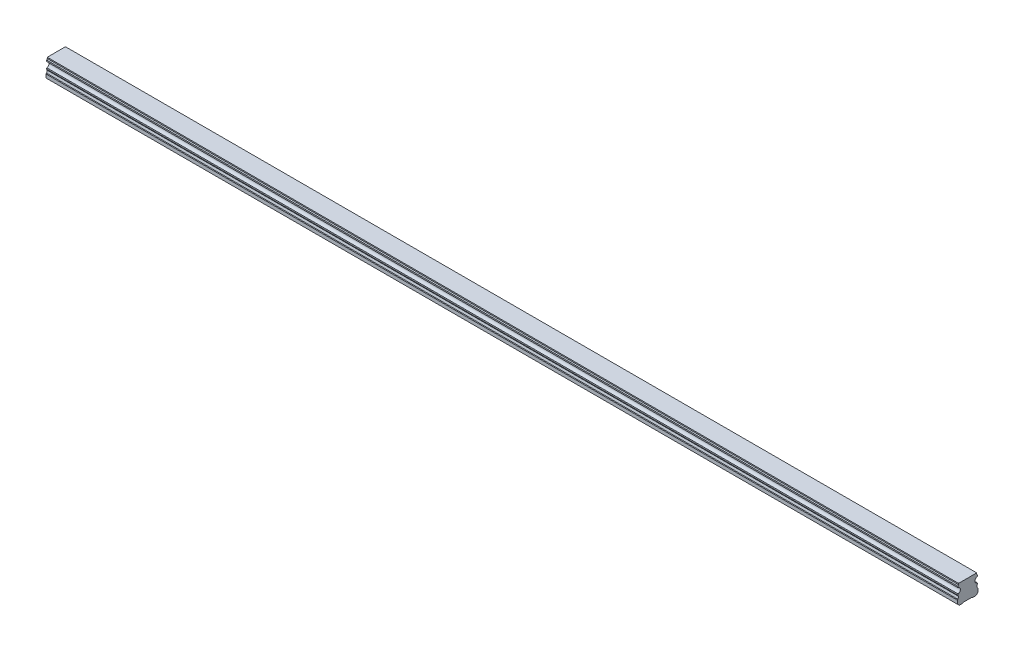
ISO-10303-21;
HEADER;
FILE_DESCRIPTION(('STEP AP214'),'2;1');
FILE_NAME('part.step','',(''),(''),'','','');
FILE_SCHEMA(('AUTOMOTIVE_DESIGN { 1 0 10303 214 1 1 1 1 }'));
ENDSEC;
DATA;
#1=APPLICATION_CONTEXT('core data for automotive mechanical design processes');
#2=APPLICATION_PROTOCOL_DEFINITION('international standard','automotive_design',2000,#1);
#3=PRODUCT_CONTEXT('',#1,'mechanical');
#4=PRODUCT('Part','Part','',(#3));
#5=PRODUCT_RELATED_PRODUCT_CATEGORY('part','',(#4));
#6=PRODUCT_DEFINITION_FORMATION('','',#4);
#7=PRODUCT_DEFINITION_CONTEXT('part definition',#1,'design');
#8=PRODUCT_DEFINITION('design','',#6,#7);
#9=PRODUCT_DEFINITION_SHAPE('','',#8);
#10=(LENGTH_UNIT() NAMED_UNIT(*) SI_UNIT(.MILLI.,.METRE.));
#11=(NAMED_UNIT(*) PLANE_ANGLE_UNIT() SI_UNIT($,.RADIAN.));
#12=(NAMED_UNIT(*) SI_UNIT($,.STERADIAN.) SOLID_ANGLE_UNIT());
#13=UNCERTAINTY_MEASURE_WITH_UNIT(LENGTH_MEASURE(1.E-05),#10,'distance_accuracy_value','');
#14=(GEOMETRIC_REPRESENTATION_CONTEXT(3) GLOBAL_UNCERTAINTY_ASSIGNED_CONTEXT((#13)) GLOBAL_UNIT_ASSIGNED_CONTEXT((#10,
#11,#12)) REPRESENTATION_CONTEXT('',''));
#15=CARTESIAN_POINT('',(0.,0.,0.));
#16=DIRECTION('',(0.,0.,1.));
#17=DIRECTION('',(1.,0.,0.));
#18=AXIS2_PLACEMENT_3D('',#15,#16,#17);
#19=CARTESIAN_POINT('',(630.,0.399999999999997,0.));
#20=DIRECTION('',(0.,-1.,0.));
#21=DIRECTION('',(0.,0.,-1.));
#22=AXIS2_PLACEMENT_3D('',#19,#20,#21);
#23=CONICAL_SURFACE('',#22,2.90000000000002,0.785398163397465);
#24=CARTESIAN_POINT('',(630.,0.799999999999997,0.));
#25=DIRECTION('',(0.,1.,0.));
#26=DIRECTION('',(0.,0.,1.));
#27=AXIS2_PLACEMENT_3D('',#24,#25,#26);
#28=CIRCLE('',#27,2.5);
#29=CARTESIAN_POINT('',(630.,0.799999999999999,2.5));
#30=VERTEX_POINT('',#29);
#31=EDGE_CURVE('E11',#30,#30,#28,.F.);
#32=ORIENTED_EDGE('',*,*,#31,.F.);
#33=EDGE_LOOP('',(#32));
#34=FACE_BOUND('',#33,.T.);
#35=CARTESIAN_POINT('',(630.,0.399999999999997,0.));
#36=DIRECTION('',(0.,1.,0.));
#37=DIRECTION('',(0.,0.,1.));
#38=AXIS2_PLACEMENT_3D('',#35,#36,#37);
#39=CIRCLE('',#38,2.90000000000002);
#40=CARTESIAN_POINT('',(630.,0.399999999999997,2.90000000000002));
#41=VERTEX_POINT('',#40);
#42=EDGE_CURVE('E529',#41,#41,#39,.T.);
#43=ORIENTED_EDGE('',*,*,#42,.F.);
#44=EDGE_LOOP('',(#43));
#45=FACE_BOUND('',#44,.T.);
#46=ADVANCED_FACE('F39',(#34,#45),#23,.F.);
#47=CARTESIAN_POINT('',(630.,7.,0.));
#48=DIRECTION('',(0.,-1.,0.));
#49=DIRECTION('',(0.,0.,-1.));
#50=AXIS2_PLACEMENT_3D('',#47,#48,#49);
#51=CYLINDRICAL_SURFACE('',#50,2.5);
#52=ORIENTED_EDGE('',*,*,#31,.T.);
#53=EDGE_LOOP('',(#52));
#54=FACE_BOUND('',#53,.T.);
#55=CARTESIAN_POINT('',(630.,7.,0.));
#56=DIRECTION('',(0.,-1.,0.));
#57=DIRECTION('',(0.,0.,-1.));
#58=AXIS2_PLACEMENT_3D('',#55,#56,#57);
#59=CIRCLE('',#58,2.5);
#60=CARTESIAN_POINT('',(630.,7.,-2.50000000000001));
#61=VERTEX_POINT('',#60);
#62=EDGE_CURVE('E49',#61,#61,#59,.T.);
#63=ORIENTED_EDGE('',*,*,#62,.F.);
#64=EDGE_LOOP('',(#63));
#65=FACE_BOUND('',#64,.T.);
#66=ADVANCED_FACE('F722',(#54,#65),#51,.F.);
#67=CARTESIAN_POINT('',(630.,7.,0.));
#68=DIRECTION('',(0.,-1.,0.));
#69=DIRECTION('',(0.,0.,-1.));
#70=AXIS2_PLACEMENT_3D('',#67,#68,#69);
#71=PLANE('',#70);
#72=CARTESIAN_POINT('',(630.,7.,0.));
#73=DIRECTION('',(0.,-1.,0.));
#74=DIRECTION('',(0.,0.,-1.));
#75=AXIS2_PLACEMENT_3D('',#72,#73,#74);
#76=CIRCLE('',#75,2.1);
#77=CARTESIAN_POINT('',(630.,7.,-2.1));
#78=VERTEX_POINT('',#77);
#79=EDGE_CURVE('E42',#78,#78,#76,.T.);
#80=ORIENTED_EDGE('',*,*,#79,.F.);
#81=EDGE_LOOP('',(#80));
#82=FACE_BOUND('',#81,.T.);
#83=ORIENTED_EDGE('',*,*,#62,.T.);
#84=EDGE_LOOP('',(#83));
#85=FACE_BOUND('',#84,.T.);
#86=ADVANCED_FACE('F727',(#82,#85),#71,.T.);
#87=CARTESIAN_POINT('',(570.,0.399999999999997,0.));
#88=DIRECTION('',(0.,-1.,0.));
#89=DIRECTION('',(0.,0.,-1.));
#90=AXIS2_PLACEMENT_3D('',#87,#88,#89);
#91=CONICAL_SURFACE('',#90,2.90000000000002,0.785398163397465);
#92=CARTESIAN_POINT('',(570.,0.799999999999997,0.));
#93=DIRECTION('',(0.,1.,0.));
#94=DIRECTION('',(0.,0.,1.));
#95=AXIS2_PLACEMENT_3D('',#92,#93,#94);
#96=CIRCLE('',#95,2.5);
#97=CARTESIAN_POINT('',(570.,0.799999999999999,2.5));
#98=VERTEX_POINT('',#97);
#99=EDGE_CURVE('E525',#98,#98,#96,.F.);
#100=ORIENTED_EDGE('',*,*,#99,.F.);
#101=EDGE_LOOP('',(#100));
#102=FACE_BOUND('',#101,.T.);
#103=CARTESIAN_POINT('',(570.,0.399999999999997,0.));
#104=DIRECTION('',(0.,1.,0.));
#105=DIRECTION('',(0.,0.,1.));
#106=AXIS2_PLACEMENT_3D('',#103,#104,#105);
#107=CIRCLE('',#106,2.90000000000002);
#108=CARTESIAN_POINT('',(570.,0.399999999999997,2.90000000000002));
#109=VERTEX_POINT('',#108);
#110=EDGE_CURVE('E517',#109,#109,#107,.T.);
#111=ORIENTED_EDGE('',*,*,#110,.F.);
#112=EDGE_LOOP('',(#111));
#113=FACE_BOUND('',#112,.T.);
#114=ADVANCED_FACE('F898',(#102,#113),#91,.F.);
#115=CARTESIAN_POINT('',(570.,7.,0.));
#116=DIRECTION('',(0.,-1.,0.));
#117=DIRECTION('',(0.,0.,-1.));
#118=AXIS2_PLACEMENT_3D('',#115,#116,#117);
#119=CYLINDRICAL_SURFACE('',#118,2.5);
#120=ORIENTED_EDGE('',*,*,#99,.T.);
#121=EDGE_LOOP('',(#120));
#122=FACE_BOUND('',#121,.T.);
#123=CARTESIAN_POINT('',(570.,7.,0.));
#124=DIRECTION('',(0.,-1.,0.));
#125=DIRECTION('',(0.,0.,-1.));
#126=AXIS2_PLACEMENT_3D('',#123,#124,#125);
#127=CIRCLE('',#126,2.5);
#128=CARTESIAN_POINT('',(570.,7.,-2.50000000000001));
#129=VERTEX_POINT('',#128);
#130=EDGE_CURVE('E521',#129,#129,#127,.T.);
#131=ORIENTED_EDGE('',*,*,#130,.F.);
#132=EDGE_LOOP('',(#131));
#133=FACE_BOUND('',#132,.T.);
#134=ADVANCED_FACE('F894',(#122,#133),#119,.F.);
#135=CARTESIAN_POINT('',(570.,7.,0.));
#136=DIRECTION('',(0.,-1.,0.));
#137=DIRECTION('',(0.,0.,-1.));
#138=AXIS2_PLACEMENT_3D('',#135,#136,#137);
#139=PLANE('',#138);
#140=CARTESIAN_POINT('',(570.,7.,0.));
#141=DIRECTION('',(0.,-1.,0.));
#142=DIRECTION('',(0.,0.,-1.));
#143=AXIS2_PLACEMENT_3D('',#140,#141,#142);
#144=CIRCLE('',#143,2.1);
#145=CARTESIAN_POINT('',(570.,7.,-2.1));
#146=VERTEX_POINT('',#145);
#147=EDGE_CURVE('E568',#146,#146,#144,.T.);
#148=ORIENTED_EDGE('',*,*,#147,.F.);
#149=EDGE_LOOP('',(#148));
#150=FACE_BOUND('',#149,.T.);
#151=ORIENTED_EDGE('',*,*,#130,.T.);
#152=EDGE_LOOP('',(#151));
#153=FACE_BOUND('',#152,.T.);
#154=ADVANCED_FACE('F890',(#150,#153),#139,.T.);
#155=CARTESIAN_POINT('',(510.,0.399999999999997,0.));
#156=DIRECTION('',(0.,-1.,0.));
#157=DIRECTION('',(0.,0.,-1.));
#158=AXIS2_PLACEMENT_3D('',#155,#156,#157);
#159=CONICAL_SURFACE('',#158,2.90000000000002,0.785398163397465);
#160=CARTESIAN_POINT('',(510.,0.799999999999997,0.));
#161=DIRECTION('',(0.,1.,0.));
#162=DIRECTION('',(0.,0.,1.));
#163=AXIS2_PLACEMENT_3D('',#160,#161,#162);
#164=CIRCLE('',#163,2.5);
#165=CARTESIAN_POINT('',(510.,0.799999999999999,2.5));
#166=VERTEX_POINT('',#165);
#167=EDGE_CURVE('E513',#166,#166,#164,.F.);
#168=ORIENTED_EDGE('',*,*,#167,.F.);
#169=EDGE_LOOP('',(#168));
#170=FACE_BOUND('',#169,.T.);
#171=CARTESIAN_POINT('',(510.,0.399999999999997,0.));
#172=DIRECTION('',(0.,1.,0.));
#173=DIRECTION('',(0.,0.,1.));
#174=AXIS2_PLACEMENT_3D('',#171,#172,#173);
#175=CIRCLE('',#174,2.90000000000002);
#176=CARTESIAN_POINT('',(510.,0.399999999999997,2.90000000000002));
#177=VERTEX_POINT('',#176);
#178=EDGE_CURVE('E505',#177,#177,#175,.T.);
#179=ORIENTED_EDGE('',*,*,#178,.F.);
#180=EDGE_LOOP('',(#179));
#181=FACE_BOUND('',#180,.T.);
#182=ADVANCED_FACE('F886',(#170,#181),#159,.F.);
#183=CARTESIAN_POINT('',(510.,7.,0.));
#184=DIRECTION('',(0.,-1.,0.));
#185=DIRECTION('',(0.,0.,-1.));
#186=AXIS2_PLACEMENT_3D('',#183,#184,#185);
#187=CYLINDRICAL_SURFACE('',#186,2.5);
#188=ORIENTED_EDGE('',*,*,#167,.T.);
#189=EDGE_LOOP('',(#188));
#190=FACE_BOUND('',#189,.T.);
#191=CARTESIAN_POINT('',(510.,7.,0.));
#192=DIRECTION('',(0.,-1.,0.));
#193=DIRECTION('',(0.,0.,-1.));
#194=AXIS2_PLACEMENT_3D('',#191,#192,#193);
#195=CIRCLE('',#194,2.5);
#196=CARTESIAN_POINT('',(510.,7.,-2.50000000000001));
#197=VERTEX_POINT('',#196);
#198=EDGE_CURVE('E509',#197,#197,#195,.T.);
#199=ORIENTED_EDGE('',*,*,#198,.F.);
#200=EDGE_LOOP('',(#199));
#201=FACE_BOUND('',#200,.T.);
#202=ADVANCED_FACE('F882',(#190,#201),#187,.F.);
#203=CARTESIAN_POINT('',(510.,7.,0.));
#204=DIRECTION('',(0.,-1.,0.));
#205=DIRECTION('',(0.,0.,-1.));
#206=AXIS2_PLACEMENT_3D('',#203,#204,#205);
#207=PLANE('',#206);
#208=CARTESIAN_POINT('',(510.,7.,0.));
#209=DIRECTION('',(0.,-1.,0.));
#210=DIRECTION('',(0.,0.,-1.));
#211=AXIS2_PLACEMENT_3D('',#208,#209,#210);
#212=CIRCLE('',#211,2.1);
#213=CARTESIAN_POINT('',(510.,7.,-2.1));
#214=VERTEX_POINT('',#213);
#215=EDGE_CURVE('E565',#214,#214,#212,.T.);
#216=ORIENTED_EDGE('',*,*,#215,.F.);
#217=EDGE_LOOP('',(#216));
#218=FACE_BOUND('',#217,.T.);
#219=ORIENTED_EDGE('',*,*,#198,.T.);
#220=EDGE_LOOP('',(#219));
#221=FACE_BOUND('',#220,.T.);
#222=ADVANCED_FACE('F878',(#218,#221),#207,.T.);
#223=CARTESIAN_POINT('',(450.,0.399999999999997,0.));
#224=DIRECTION('',(0.,-1.,0.));
#225=DIRECTION('',(0.,0.,-1.));
#226=AXIS2_PLACEMENT_3D('',#223,#224,#225);
#227=CONICAL_SURFACE('',#226,2.90000000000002,0.785398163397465);
#228=CARTESIAN_POINT('',(450.,0.799999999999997,0.));
#229=DIRECTION('',(0.,1.,0.));
#230=DIRECTION('',(0.,0.,1.));
#231=AXIS2_PLACEMENT_3D('',#228,#229,#230);
#232=CIRCLE('',#231,2.5);
#233=CARTESIAN_POINT('',(450.,0.799999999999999,2.5));
#234=VERTEX_POINT('',#233);
#235=EDGE_CURVE('E501',#234,#234,#232,.F.);
#236=ORIENTED_EDGE('',*,*,#235,.F.);
#237=EDGE_LOOP('',(#236));
#238=FACE_BOUND('',#237,.T.);
#239=CARTESIAN_POINT('',(450.,0.399999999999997,0.));
#240=DIRECTION('',(0.,1.,0.));
#241=DIRECTION('',(0.,0.,1.));
#242=AXIS2_PLACEMENT_3D('',#239,#240,#241);
#243=CIRCLE('',#242,2.90000000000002);
#244=CARTESIAN_POINT('',(450.,0.399999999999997,2.90000000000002));
#245=VERTEX_POINT('',#244);
#246=EDGE_CURVE('E493',#245,#245,#243,.T.);
#247=ORIENTED_EDGE('',*,*,#246,.F.);
#248=EDGE_LOOP('',(#247));
#249=FACE_BOUND('',#248,.T.);
#250=ADVANCED_FACE('F874',(#238,#249),#227,.F.);
#251=CARTESIAN_POINT('',(450.,7.,0.));
#252=DIRECTION('',(0.,-1.,0.));
#253=DIRECTION('',(0.,0.,-1.));
#254=AXIS2_PLACEMENT_3D('',#251,#252,#253);
#255=CYLINDRICAL_SURFACE('',#254,2.5);
#256=ORIENTED_EDGE('',*,*,#235,.T.);
#257=EDGE_LOOP('',(#256));
#258=FACE_BOUND('',#257,.T.);
#259=CARTESIAN_POINT('',(450.,7.,0.));
#260=DIRECTION('',(0.,-1.,0.));
#261=DIRECTION('',(0.,0.,-1.));
#262=AXIS2_PLACEMENT_3D('',#259,#260,#261);
#263=CIRCLE('',#262,2.5);
#264=CARTESIAN_POINT('',(450.,7.,-2.50000000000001));
#265=VERTEX_POINT('',#264);
#266=EDGE_CURVE('E497',#265,#265,#263,.T.);
#267=ORIENTED_EDGE('',*,*,#266,.F.);
#268=EDGE_LOOP('',(#267));
#269=FACE_BOUND('',#268,.T.);
#270=ADVANCED_FACE('F870',(#258,#269),#255,.F.);
#271=CARTESIAN_POINT('',(450.,7.,0.));
#272=DIRECTION('',(0.,-1.,0.));
#273=DIRECTION('',(0.,0.,-1.));
#274=AXIS2_PLACEMENT_3D('',#271,#272,#273);
#275=PLANE('',#274);
#276=CARTESIAN_POINT('',(450.,7.,0.));
#277=DIRECTION('',(0.,-1.,0.));
#278=DIRECTION('',(0.,0.,-1.));
#279=AXIS2_PLACEMENT_3D('',#276,#277,#278);
#280=CIRCLE('',#279,2.1);
#281=CARTESIAN_POINT('',(450.,7.,-2.1));
#282=VERTEX_POINT('',#281);
#283=EDGE_CURVE('E561',#282,#282,#280,.T.);
#284=ORIENTED_EDGE('',*,*,#283,.F.);
#285=EDGE_LOOP('',(#284));
#286=FACE_BOUND('',#285,.T.);
#287=ORIENTED_EDGE('',*,*,#266,.T.);
#288=EDGE_LOOP('',(#287));
#289=FACE_BOUND('',#288,.T.);
#290=ADVANCED_FACE('F866',(#286,#289),#275,.T.);
#291=CARTESIAN_POINT('',(390.,0.399999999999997,0.));
#292=DIRECTION('',(0.,-1.,0.));
#293=DIRECTION('',(0.,0.,-1.));
#294=AXIS2_PLACEMENT_3D('',#291,#292,#293);
#295=CONICAL_SURFACE('',#294,2.90000000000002,0.785398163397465);
#296=CARTESIAN_POINT('',(390.,0.799999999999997,0.));
#297=DIRECTION('',(0.,1.,0.));
#298=DIRECTION('',(0.,0.,1.));
#299=AXIS2_PLACEMENT_3D('',#296,#297,#298);
#300=CIRCLE('',#299,2.5);
#301=CARTESIAN_POINT('',(390.,0.799999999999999,2.5));
#302=VERTEX_POINT('',#301);
#303=EDGE_CURVE('E489',#302,#302,#300,.F.);
#304=ORIENTED_EDGE('',*,*,#303,.F.);
#305=EDGE_LOOP('',(#304));
#306=FACE_BOUND('',#305,.T.);
#307=CARTESIAN_POINT('',(390.,0.399999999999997,0.));
#308=DIRECTION('',(0.,1.,0.));
#309=DIRECTION('',(0.,0.,1.));
#310=AXIS2_PLACEMENT_3D('',#307,#308,#309);
#311=CIRCLE('',#310,2.90000000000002);
#312=CARTESIAN_POINT('',(390.,0.399999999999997,2.90000000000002));
#313=VERTEX_POINT('',#312);
#314=EDGE_CURVE('E481',#313,#313,#311,.T.);
#315=ORIENTED_EDGE('',*,*,#314,.F.);
#316=EDGE_LOOP('',(#315));
#317=FACE_BOUND('',#316,.T.);
#318=ADVANCED_FACE('F862',(#306,#317),#295,.F.);
#319=CARTESIAN_POINT('',(390.,7.,0.));
#320=DIRECTION('',(0.,-1.,0.));
#321=DIRECTION('',(0.,0.,-1.));
#322=AXIS2_PLACEMENT_3D('',#319,#320,#321);
#323=CYLINDRICAL_SURFACE('',#322,2.5);
#324=ORIENTED_EDGE('',*,*,#303,.T.);
#325=EDGE_LOOP('',(#324));
#326=FACE_BOUND('',#325,.T.);
#327=CARTESIAN_POINT('',(390.,7.,0.));
#328=DIRECTION('',(0.,-1.,0.));
#329=DIRECTION('',(0.,0.,-1.));
#330=AXIS2_PLACEMENT_3D('',#327,#328,#329);
#331=CIRCLE('',#330,2.5);
#332=CARTESIAN_POINT('',(390.,7.,-2.50000000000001));
#333=VERTEX_POINT('',#332);
#334=EDGE_CURVE('E485',#333,#333,#331,.T.);
#335=ORIENTED_EDGE('',*,*,#334,.F.);
#336=EDGE_LOOP('',(#335));
#337=FACE_BOUND('',#336,.T.);
#338=ADVANCED_FACE('F858',(#326,#337),#323,.F.);
#339=CARTESIAN_POINT('',(390.,7.,0.));
#340=DIRECTION('',(0.,-1.,0.));
#341=DIRECTION('',(0.,0.,-1.));
#342=AXIS2_PLACEMENT_3D('',#339,#340,#341);
#343=PLANE('',#342);
#344=CARTESIAN_POINT('',(390.,7.,0.));
#345=DIRECTION('',(0.,-1.,0.));
#346=DIRECTION('',(0.,0.,-1.));
#347=AXIS2_PLACEMENT_3D('',#344,#345,#346);
#348=CIRCLE('',#347,2.1);
#349=CARTESIAN_POINT('',(390.,7.,-2.1));
#350=VERTEX_POINT('',#349);
#351=EDGE_CURVE('E557',#350,#350,#348,.T.);
#352=ORIENTED_EDGE('',*,*,#351,.F.);
#353=EDGE_LOOP('',(#352));
#354=FACE_BOUND('',#353,.T.);
#355=ORIENTED_EDGE('',*,*,#334,.T.);
#356=EDGE_LOOP('',(#355));
#357=FACE_BOUND('',#356,.T.);
#358=ADVANCED_FACE('F854',(#354,#357),#343,.T.);
#359=CARTESIAN_POINT('',(330.,0.399999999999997,0.));
#360=DIRECTION('',(0.,-1.,0.));
#361=DIRECTION('',(0.,0.,-1.));
#362=AXIS2_PLACEMENT_3D('',#359,#360,#361);
#363=CONICAL_SURFACE('',#362,2.90000000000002,0.785398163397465);
#364=CARTESIAN_POINT('',(330.,0.799999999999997,0.));
#365=DIRECTION('',(0.,1.,0.));
#366=DIRECTION('',(0.,0.,1.));
#367=AXIS2_PLACEMENT_3D('',#364,#365,#366);
#368=CIRCLE('',#367,2.5);
#369=CARTESIAN_POINT('',(330.,0.799999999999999,2.5));
#370=VERTEX_POINT('',#369);
#371=EDGE_CURVE('E477',#370,#370,#368,.F.);
#372=ORIENTED_EDGE('',*,*,#371,.F.);
#373=EDGE_LOOP('',(#372));
#374=FACE_BOUND('',#373,.T.);
#375=CARTESIAN_POINT('',(330.,0.399999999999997,0.));
#376=DIRECTION('',(0.,1.,0.));
#377=DIRECTION('',(0.,0.,1.));
#378=AXIS2_PLACEMENT_3D('',#375,#376,#377);
#379=CIRCLE('',#378,2.90000000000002);
#380=CARTESIAN_POINT('',(330.,0.399999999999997,2.90000000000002));
#381=VERTEX_POINT('',#380);
#382=EDGE_CURVE('E469',#381,#381,#379,.T.);
#383=ORIENTED_EDGE('',*,*,#382,.F.);
#384=EDGE_LOOP('',(#383));
#385=FACE_BOUND('',#384,.T.);
#386=ADVANCED_FACE('F850',(#374,#385),#363,.F.);
#387=CARTESIAN_POINT('',(330.,7.,0.));
#388=DIRECTION('',(0.,-1.,0.));
#389=DIRECTION('',(0.,0.,-1.));
#390=AXIS2_PLACEMENT_3D('',#387,#388,#389);
#391=CYLINDRICAL_SURFACE('',#390,2.5);
#392=ORIENTED_EDGE('',*,*,#371,.T.);
#393=EDGE_LOOP('',(#392));
#394=FACE_BOUND('',#393,.T.);
#395=CARTESIAN_POINT('',(330.,7.,0.));
#396=DIRECTION('',(0.,-1.,0.));
#397=DIRECTION('',(0.,0.,-1.));
#398=AXIS2_PLACEMENT_3D('',#395,#396,#397);
#399=CIRCLE('',#398,2.5);
#400=CARTESIAN_POINT('',(330.,7.,-2.50000000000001));
#401=VERTEX_POINT('',#400);
#402=EDGE_CURVE('E473',#401,#401,#399,.T.);
#403=ORIENTED_EDGE('',*,*,#402,.F.);
#404=EDGE_LOOP('',(#403));
#405=FACE_BOUND('',#404,.T.);
#406=ADVANCED_FACE('F846',(#394,#405),#391,.F.);
#407=CARTESIAN_POINT('',(330.,7.,0.));
#408=DIRECTION('',(0.,-1.,0.));
#409=DIRECTION('',(0.,0.,-1.));
#410=AXIS2_PLACEMENT_3D('',#407,#408,#409);
#411=PLANE('',#410);
#412=CARTESIAN_POINT('',(330.,7.,0.));
#413=DIRECTION('',(0.,-1.,0.));
#414=DIRECTION('',(0.,0.,-1.));
#415=AXIS2_PLACEMENT_3D('',#412,#413,#414);
#416=CIRCLE('',#415,2.1);
#417=CARTESIAN_POINT('',(330.,7.,-2.1));
#418=VERTEX_POINT('',#417);
#419=EDGE_CURVE('E553',#418,#418,#416,.T.);
#420=ORIENTED_EDGE('',*,*,#419,.F.);
#421=EDGE_LOOP('',(#420));
#422=FACE_BOUND('',#421,.T.);
#423=ORIENTED_EDGE('',*,*,#402,.T.);
#424=EDGE_LOOP('',(#423));
#425=FACE_BOUND('',#424,.T.);
#426=ADVANCED_FACE('F842',(#422,#425),#411,.T.);
#427=CARTESIAN_POINT('',(270.,0.399999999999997,0.));
#428=DIRECTION('',(0.,-1.,0.));
#429=DIRECTION('',(0.,0.,-1.));
#430=AXIS2_PLACEMENT_3D('',#427,#428,#429);
#431=CONICAL_SURFACE('',#430,2.90000000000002,0.785398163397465);
#432=CARTESIAN_POINT('',(270.,0.799999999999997,0.));
#433=DIRECTION('',(0.,1.,0.));
#434=DIRECTION('',(0.,0.,1.));
#435=AXIS2_PLACEMENT_3D('',#432,#433,#434);
#436=CIRCLE('',#435,2.5);
#437=CARTESIAN_POINT('',(270.,0.799999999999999,2.5));
#438=VERTEX_POINT('',#437);
#439=EDGE_CURVE('E465',#438,#438,#436,.F.);
#440=ORIENTED_EDGE('',*,*,#439,.F.);
#441=EDGE_LOOP('',(#440));
#442=FACE_BOUND('',#441,.T.);
#443=CARTESIAN_POINT('',(270.,0.399999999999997,0.));
#444=DIRECTION('',(0.,1.,0.));
#445=DIRECTION('',(0.,0.,1.));
#446=AXIS2_PLACEMENT_3D('',#443,#444,#445);
#447=CIRCLE('',#446,2.90000000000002);
#448=CARTESIAN_POINT('',(270.,0.399999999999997,2.90000000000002));
#449=VERTEX_POINT('',#448);
#450=EDGE_CURVE('E457',#449,#449,#447,.T.);
#451=ORIENTED_EDGE('',*,*,#450,.F.);
#452=EDGE_LOOP('',(#451));
#453=FACE_BOUND('',#452,.T.);
#454=ADVANCED_FACE('F838',(#442,#453),#431,.F.);
#455=CARTESIAN_POINT('',(270.,7.,0.));
#456=DIRECTION('',(0.,-1.,0.));
#457=DIRECTION('',(0.,0.,-1.));
#458=AXIS2_PLACEMENT_3D('',#455,#456,#457);
#459=CYLINDRICAL_SURFACE('',#458,2.5);
#460=ORIENTED_EDGE('',*,*,#439,.T.);
#461=EDGE_LOOP('',(#460));
#462=FACE_BOUND('',#461,.T.);
#463=CARTESIAN_POINT('',(270.,7.,0.));
#464=DIRECTION('',(0.,-1.,0.));
#465=DIRECTION('',(0.,0.,-1.));
#466=AXIS2_PLACEMENT_3D('',#463,#464,#465);
#467=CIRCLE('',#466,2.5);
#468=CARTESIAN_POINT('',(270.,7.,-2.50000000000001));
#469=VERTEX_POINT('',#468);
#470=EDGE_CURVE('E461',#469,#469,#467,.T.);
#471=ORIENTED_EDGE('',*,*,#470,.F.);
#472=EDGE_LOOP('',(#471));
#473=FACE_BOUND('',#472,.T.);
#474=ADVANCED_FACE('F834',(#462,#473),#459,.F.);
#475=CARTESIAN_POINT('',(270.,7.,0.));
#476=DIRECTION('',(0.,-1.,0.));
#477=DIRECTION('',(0.,0.,-1.));
#478=AXIS2_PLACEMENT_3D('',#475,#476,#477);
#479=PLANE('',#478);
#480=CARTESIAN_POINT('',(270.,7.,0.));
#481=DIRECTION('',(0.,-1.,0.));
#482=DIRECTION('',(0.,0.,-1.));
#483=AXIS2_PLACEMENT_3D('',#480,#481,#482);
#484=CIRCLE('',#483,2.1);
#485=CARTESIAN_POINT('',(270.,7.,-2.1));
#486=VERTEX_POINT('',#485);
#487=EDGE_CURVE('E549',#486,#486,#484,.T.);
#488=ORIENTED_EDGE('',*,*,#487,.F.);
#489=EDGE_LOOP('',(#488));
#490=FACE_BOUND('',#489,.T.);
#491=ORIENTED_EDGE('',*,*,#470,.T.);
#492=EDGE_LOOP('',(#491));
#493=FACE_BOUND('',#492,.T.);
#494=ADVANCED_FACE('F830',(#490,#493),#479,.T.);
#495=CARTESIAN_POINT('',(210.,0.399999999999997,0.));
#496=DIRECTION('',(0.,-1.,0.));
#497=DIRECTION('',(0.,0.,-1.));
#498=AXIS2_PLACEMENT_3D('',#495,#496,#497);
#499=CONICAL_SURFACE('',#498,2.90000000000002,0.785398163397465);
#500=CARTESIAN_POINT('',(210.,0.799999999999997,0.));
#501=DIRECTION('',(0.,1.,0.));
#502=DIRECTION('',(0.,0.,1.));
#503=AXIS2_PLACEMENT_3D('',#500,#501,#502);
#504=CIRCLE('',#503,2.5);
#505=CARTESIAN_POINT('',(210.,0.799999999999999,2.5));
#506=VERTEX_POINT('',#505);
#507=EDGE_CURVE('E453',#506,#506,#504,.F.);
#508=ORIENTED_EDGE('',*,*,#507,.F.);
#509=EDGE_LOOP('',(#508));
#510=FACE_BOUND('',#509,.T.);
#511=CARTESIAN_POINT('',(210.,0.399999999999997,0.));
#512=DIRECTION('',(0.,1.,0.));
#513=DIRECTION('',(0.,0.,1.));
#514=AXIS2_PLACEMENT_3D('',#511,#512,#513);
#515=CIRCLE('',#514,2.90000000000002);
#516=CARTESIAN_POINT('',(210.,0.399999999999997,2.90000000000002));
#517=VERTEX_POINT('',#516);
#518=EDGE_CURVE('E445',#517,#517,#515,.T.);
#519=ORIENTED_EDGE('',*,*,#518,.F.);
#520=EDGE_LOOP('',(#519));
#521=FACE_BOUND('',#520,.T.);
#522=ADVANCED_FACE('F826',(#510,#521),#499,.F.);
#523=CARTESIAN_POINT('',(210.,7.,0.));
#524=DIRECTION('',(0.,-1.,0.));
#525=DIRECTION('',(0.,0.,-1.));
#526=AXIS2_PLACEMENT_3D('',#523,#524,#525);
#527=CYLINDRICAL_SURFACE('',#526,2.5);
#528=ORIENTED_EDGE('',*,*,#507,.T.);
#529=EDGE_LOOP('',(#528));
#530=FACE_BOUND('',#529,.T.);
#531=CARTESIAN_POINT('',(210.,7.,0.));
#532=DIRECTION('',(0.,-1.,0.));
#533=DIRECTION('',(0.,0.,-1.));
#534=AXIS2_PLACEMENT_3D('',#531,#532,#533);
#535=CIRCLE('',#534,2.5);
#536=CARTESIAN_POINT('',(210.,7.,-2.50000000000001));
#537=VERTEX_POINT('',#536);
#538=EDGE_CURVE('E449',#537,#537,#535,.T.);
#539=ORIENTED_EDGE('',*,*,#538,.F.);
#540=EDGE_LOOP('',(#539));
#541=FACE_BOUND('',#540,.T.);
#542=ADVANCED_FACE('F822',(#530,#541),#527,.F.);
#543=CARTESIAN_POINT('',(210.,7.,0.));
#544=DIRECTION('',(0.,-1.,0.));
#545=DIRECTION('',(0.,0.,-1.));
#546=AXIS2_PLACEMENT_3D('',#543,#544,#545);
#547=PLANE('',#546);
#548=CARTESIAN_POINT('',(210.,7.,0.));
#549=DIRECTION('',(0.,-1.,0.));
#550=DIRECTION('',(0.,0.,-1.));
#551=AXIS2_PLACEMENT_3D('',#548,#549,#550);
#552=CIRCLE('',#551,2.1);
#553=CARTESIAN_POINT('',(210.,7.,-2.1));
#554=VERTEX_POINT('',#553);
#555=EDGE_CURVE('E545',#554,#554,#552,.T.);
#556=ORIENTED_EDGE('',*,*,#555,.F.);
#557=EDGE_LOOP('',(#556));
#558=FACE_BOUND('',#557,.T.);
#559=ORIENTED_EDGE('',*,*,#538,.T.);
#560=EDGE_LOOP('',(#559));
#561=FACE_BOUND('',#560,.T.);
#562=ADVANCED_FACE('F818',(#558,#561),#547,.T.);
#563=CARTESIAN_POINT('',(150.,0.399999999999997,0.));
#564=DIRECTION('',(0.,-1.,0.));
#565=DIRECTION('',(0.,0.,-1.));
#566=AXIS2_PLACEMENT_3D('',#563,#564,#565);
#567=CONICAL_SURFACE('',#566,2.90000000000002,0.785398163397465);
#568=CARTESIAN_POINT('',(150.,0.799999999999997,0.));
#569=DIRECTION('',(0.,1.,0.));
#570=DIRECTION('',(0.,0.,1.));
#571=AXIS2_PLACEMENT_3D('',#568,#569,#570);
#572=CIRCLE('',#571,2.5);
#573=CARTESIAN_POINT('',(150.,0.799999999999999,2.5));
#574=VERTEX_POINT('',#573);
#575=EDGE_CURVE('E441',#574,#574,#572,.F.);
#576=ORIENTED_EDGE('',*,*,#575,.F.);
#577=EDGE_LOOP('',(#576));
#578=FACE_BOUND('',#577,.T.);
#579=CARTESIAN_POINT('',(150.,0.399999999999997,0.));
#580=DIRECTION('',(0.,1.,0.));
#581=DIRECTION('',(0.,0.,1.));
#582=AXIS2_PLACEMENT_3D('',#579,#580,#581);
#583=CIRCLE('',#582,2.90000000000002);
#584=CARTESIAN_POINT('',(150.,0.399999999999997,2.90000000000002));
#585=VERTEX_POINT('',#584);
#586=EDGE_CURVE('E433',#585,#585,#583,.T.);
#587=ORIENTED_EDGE('',*,*,#586,.F.);
#588=EDGE_LOOP('',(#587));
#589=FACE_BOUND('',#588,.T.);
#590=ADVANCED_FACE('F814',(#578,#589),#567,.F.);
#591=CARTESIAN_POINT('',(150.,7.,0.));
#592=DIRECTION('',(0.,-1.,0.));
#593=DIRECTION('',(0.,0.,-1.));
#594=AXIS2_PLACEMENT_3D('',#591,#592,#593);
#595=CYLINDRICAL_SURFACE('',#594,2.5);
#596=ORIENTED_EDGE('',*,*,#575,.T.);
#597=EDGE_LOOP('',(#596));
#598=FACE_BOUND('',#597,.T.);
#599=CARTESIAN_POINT('',(150.,7.,0.));
#600=DIRECTION('',(0.,-1.,0.));
#601=DIRECTION('',(0.,0.,-1.));
#602=AXIS2_PLACEMENT_3D('',#599,#600,#601);
#603=CIRCLE('',#602,2.5);
#604=CARTESIAN_POINT('',(150.,7.,-2.50000000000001));
#605=VERTEX_POINT('',#604);
#606=EDGE_CURVE('E437',#605,#605,#603,.T.);
#607=ORIENTED_EDGE('',*,*,#606,.F.);
#608=EDGE_LOOP('',(#607));
#609=FACE_BOUND('',#608,.T.);
#610=ADVANCED_FACE('F810',(#598,#609),#595,.F.);
#611=CARTESIAN_POINT('',(150.,7.,0.));
#612=DIRECTION('',(0.,-1.,0.));
#613=DIRECTION('',(0.,0.,-1.));
#614=AXIS2_PLACEMENT_3D('',#611,#612,#613);
#615=PLANE('',#614);
#616=CARTESIAN_POINT('',(150.,7.,0.));
#617=DIRECTION('',(0.,-1.,0.));
#618=DIRECTION('',(0.,0.,-1.));
#619=AXIS2_PLACEMENT_3D('',#616,#617,#618);
#620=CIRCLE('',#619,2.1);
#621=CARTESIAN_POINT('',(150.,7.,-2.1));
#622=VERTEX_POINT('',#621);
#623=EDGE_CURVE('E540',#622,#622,#620,.T.);
#624=ORIENTED_EDGE('',*,*,#623,.F.);
#625=EDGE_LOOP('',(#624));
#626=FACE_BOUND('',#625,.T.);
#627=ORIENTED_EDGE('',*,*,#606,.T.);
#628=EDGE_LOOP('',(#627));
#629=FACE_BOUND('',#628,.T.);
#630=ADVANCED_FACE('F800',(#626,#629),#615,.T.);
#631=CARTESIAN_POINT('',(660.,14.,-6.59000000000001));
#632=DIRECTION('',(0.,0.,1.));
#633=DIRECTION('',(0.,-1.,0.));
#634=AXIS2_PLACEMENT_3D('',#631,#632,#633);
#635=PLANE('',#634);
#636=DIRECTION('',(0.,1.,0.));
#637=VECTOR('',#636,1.);
#638=CARTESIAN_POINT('',(0.,14.,-6.59000000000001));
#639=LINE('',#638,#637);
#640=CARTESIAN_POINT('',(0.,13.15,-6.59));
#641=VERTEX_POINT('',#640);
#642=CARTESIAN_POINT('',(0.,14.,-6.59000000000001));
#643=VERTEX_POINT('',#642);
#644=EDGE_CURVE('E255',#641,#643,#639,.T.);
#645=ORIENTED_EDGE('',*,*,#644,.T.);
#646=DIRECTION('',(-1.,0.,0.));
#647=VECTOR('',#646,1.);
#648=CARTESIAN_POINT('',(660.,14.,-6.59000000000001));
#649=LINE('',#648,#647);
#650=CARTESIAN_POINT('',(660.,14.,-6.59000000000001));
#651=VERTEX_POINT('',#650);
#652=EDGE_CURVE('E422',#651,#643,#649,.T.);
#653=ORIENTED_EDGE('',*,*,#652,.F.);
#654=DIRECTION('',(0.,1.,0.));
#655=VECTOR('',#654,1.);
#656=CARTESIAN_POINT('',(660.,14.,-6.59000000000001));
#657=LINE('',#656,#655);
#658=CARTESIAN_POINT('',(660.,13.15,-6.59));
#659=VERTEX_POINT('',#658);
#660=EDGE_CURVE('E332',#659,#651,#657,.T.);
#661=ORIENTED_EDGE('',*,*,#660,.F.);
#662=DIRECTION('',(-1.,0.,0.));
#663=VECTOR('',#662,1.);
#664=CARTESIAN_POINT('',(660.,13.15,-6.59));
#665=LINE('',#664,#663);
#666=EDGE_CURVE('E251',#659,#641,#665,.T.);
#667=ORIENTED_EDGE('',*,*,#666,.T.);
#668=EDGE_LOOP('',(#645,#653,#661,#667));
#669=FACE_BOUND('',#668,.T.);
#670=ADVANCED_FACE('F797',(#669),#635,.F.);
#671=CARTESIAN_POINT('',(660.,14.,-6.59000000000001));
#672=DIRECTION('',(0.,-1.,0.));
#673=DIRECTION('',(0.,0.,-1.));
#674=AXIS2_PLACEMENT_3D('',#671,#672,#673);
#675=PLANE('',#674);
#676=DIRECTION('',(0.,0.,1.));
#677=VECTOR('',#676,1.);
#678=CARTESIAN_POINT('',(0.,14.,-6.59000000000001));
#679=LINE('',#678,#677);
#680=CARTESIAN_POINT('',(0.,14.,6.59));
#681=VERTEX_POINT('',#680);
#682=EDGE_CURVE('E259',#643,#681,#679,.T.);
#683=ORIENTED_EDGE('',*,*,#682,.T.);
#684=DIRECTION('',(-1.,0.,0.));
#685=VECTOR('',#684,1.);
#686=CARTESIAN_POINT('',(660.,14.,6.59));
#687=LINE('',#686,#685);
#688=CARTESIAN_POINT('',(660.,14.,6.59));
#689=VERTEX_POINT('',#688);
#690=EDGE_CURVE('E418',#689,#681,#687,.T.);
#691=ORIENTED_EDGE('',*,*,#690,.F.);
#692=DIRECTION('',(0.,0.,1.));
#693=VECTOR('',#692,1.);
#694=CARTESIAN_POINT('',(660.,14.,-6.59000000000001));
#695=LINE('',#694,#693);
#696=EDGE_CURVE('E157',#651,#689,#695,.T.);
#697=ORIENTED_EDGE('',*,*,#696,.F.);
#698=ORIENTED_EDGE('',*,*,#652,.T.);
#699=EDGE_LOOP('',(#683,#691,#697,#698));
#700=FACE_BOUND('',#699,.T.);
#701=ADVANCED_FACE('F793',(#700),#675,.F.);
#702=CARTESIAN_POINT('',(660.,14.,6.59));
#703=DIRECTION('',(0.,0.,-1.));
#704=DIRECTION('',(0.,1.,0.));
#705=AXIS2_PLACEMENT_3D('',#702,#703,#704);
#706=PLANE('',#705);
#707=DIRECTION('',(0.,-1.,0.));
#708=VECTOR('',#707,1.);
#709=CARTESIAN_POINT('',(0.,14.,6.59));
#710=LINE('',#709,#708);
#711=CARTESIAN_POINT('',(0.,13.15,6.59));
#712=VERTEX_POINT('',#711);
#713=EDGE_CURVE('E263',#681,#712,#710,.T.);
#714=ORIENTED_EDGE('',*,*,#713,.T.);
#715=DIRECTION('',(-1.,0.,0.));
#716=VECTOR('',#715,1.);
#717=CARTESIAN_POINT('',(660.,13.15,6.59));
#718=LINE('',#717,#716);
#719=CARTESIAN_POINT('',(660.,13.15,6.59));
#720=VERTEX_POINT('',#719);
#721=EDGE_CURVE('E414',#720,#712,#718,.T.);
#722=ORIENTED_EDGE('',*,*,#721,.F.);
#723=DIRECTION('',(0.,-1.,0.));
#724=VECTOR('',#723,1.);
#725=CARTESIAN_POINT('',(660.,14.,6.59));
#726=LINE('',#725,#724);
#727=EDGE_CURVE('E611',#689,#720,#726,.T.);
#728=ORIENTED_EDGE('',*,*,#727,.F.);
#729=ORIENTED_EDGE('',*,*,#690,.T.);
#730=EDGE_LOOP('',(#714,#722,#728,#729));
#731=FACE_BOUND('',#730,.T.);
#732=ADVANCED_FACE('F789',(#731),#706,.F.);
#733=CARTESIAN_POINT('',(660.,13.15,6.59));
#734=DIRECTION('',(0.,-0.422618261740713,-0.906307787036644));
#735=DIRECTION('',(0.,0.906307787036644,-0.422618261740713));
#736=AXIS2_PLACEMENT_3D('',#733,#734,#735);
#737=PLANE('',#736);
#738=DIRECTION('',(0.,-0.906307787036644,0.422618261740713));
#739=VECTOR('',#738,1.);
#740=CARTESIAN_POINT('',(0.,13.15,6.59));
#741=LINE('',#740,#739);
#742=CARTESIAN_POINT('',(0.,12.3565324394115,6.96));
#743=VERTEX_POINT('',#742);
#744=EDGE_CURVE('E266',#712,#743,#741,.T.);
#745=ORIENTED_EDGE('',*,*,#744,.T.);
#746=DIRECTION('',(-1.,0.,0.));
#747=VECTOR('',#746,1.);
#748=CARTESIAN_POINT('',(660.,12.3565324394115,6.96));
#749=LINE('',#748,#747);
#750=CARTESIAN_POINT('',(660.,12.3565324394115,6.96));
#751=VERTEX_POINT('',#750);
#752=EDGE_CURVE('E410',#751,#743,#749,.T.);
#753=ORIENTED_EDGE('',*,*,#752,.F.);
#754=DIRECTION('',(0.,-0.906307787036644,0.422618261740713));
#755=VECTOR('',#754,1.);
#756=CARTESIAN_POINT('',(660.,13.15,6.59));
#757=LINE('',#756,#755);
#758=EDGE_CURVE('E614',#720,#751,#757,.T.);
#759=ORIENTED_EDGE('',*,*,#758,.F.);
#760=ORIENTED_EDGE('',*,*,#721,.T.);
#761=EDGE_LOOP('',(#745,#753,#759,#760));
#762=FACE_BOUND('',#761,.T.);
#763=ADVANCED_FACE('F785',(#762),#737,.F.);
#764=CARTESIAN_POINT('',(660.,12.3565324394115,6.96));
#765=DIRECTION('',(0.,0.,-1.));
#766=DIRECTION('',(0.,1.,0.));
#767=AXIS2_PLACEMENT_3D('',#764,#765,#766);
#768=PLANE('',#767);
#769=DIRECTION('',(0.,-1.,0.));
#770=VECTOR('',#769,1.);
#771=CARTESIAN_POINT('',(0.,12.3565324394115,6.96));
#772=LINE('',#771,#770);
#773=CARTESIAN_POINT('',(0.,11.4351744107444,6.96));
#774=VERTEX_POINT('',#773);
#775=EDGE_CURVE('E269',#743,#774,#772,.T.);
#776=ORIENTED_EDGE('',*,*,#775,.T.);
#777=DIRECTION('',(-1.,0.,0.));
#778=VECTOR('',#777,1.);
#779=CARTESIAN_POINT('',(660.,11.4351744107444,6.96));
#780=LINE('',#779,#778);
#781=CARTESIAN_POINT('',(660.,11.4351744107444,6.96));
#782=VERTEX_POINT('',#781);
#783=EDGE_CURVE('E406',#782,#774,#780,.T.);
#784=ORIENTED_EDGE('',*,*,#783,.F.);
#785=DIRECTION('',(0.,-1.,0.));
#786=VECTOR('',#785,1.);
#787=CARTESIAN_POINT('',(660.,12.3565324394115,6.96));
#788=LINE('',#787,#786);
#789=EDGE_CURVE('E617',#751,#782,#788,.T.);
#790=ORIENTED_EDGE('',*,*,#789,.F.);
#791=ORIENTED_EDGE('',*,*,#752,.T.);
#792=EDGE_LOOP('',(#776,#784,#790,#791));
#793=FACE_BOUND('',#792,.T.);
#794=ADVANCED_FACE('F781',(#793),#768,.F.);
#795=CARTESIAN_POINT('',(660.,9.5,7.2));
#796=DIRECTION('',(-1.,0.,0.));
#797=DIRECTION('',(0.,0.,1.));
#798=AXIS2_PLACEMENT_3D('',#795,#796,#797);
#799=CYLINDRICAL_SURFACE('',#798,1.95);
#800=CARTESIAN_POINT('',(0.,9.5,7.2));
#801=DIRECTION('',(-1.,0.,0.));
#802=DIRECTION('',(0.,0.,-1.));
#803=AXIS2_PLACEMENT_3D('',#800,#801,#802);
#804=CIRCLE('',#803,1.95);
#805=CARTESIAN_POINT('',(0.,7.56482558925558,6.96));
#806=VERTEX_POINT('',#805);
#807=EDGE_CURVE('E272',#774,#806,#804,.T.);
#808=ORIENTED_EDGE('',*,*,#807,.T.);
#809=DIRECTION('',(-1.,0.,0.));
#810=VECTOR('',#809,1.);
#811=CARTESIAN_POINT('',(660.,7.56482558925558,6.96));
#812=LINE('',#811,#810);
#813=CARTESIAN_POINT('',(660.,7.56482558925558,6.96));
#814=VERTEX_POINT('',#813);
#815=EDGE_CURVE('E402',#814,#806,#812,.T.);
#816=ORIENTED_EDGE('',*,*,#815,.F.);
#817=CARTESIAN_POINT('',(660.,9.5,7.2));
#818=DIRECTION('',(-1.,0.,0.));
#819=DIRECTION('',(0.,0.,-1.));
#820=AXIS2_PLACEMENT_3D('',#817,#818,#819);
#821=CIRCLE('',#820,1.95);
#822=EDGE_CURVE('E620',#782,#814,#821,.T.);
#823=ORIENTED_EDGE('',*,*,#822,.F.);
#824=ORIENTED_EDGE('',*,*,#783,.T.);
#825=EDGE_LOOP('',(#808,#816,#823,#824));
#826=FACE_BOUND('',#825,.T.);
#827=ADVANCED_FACE('F777',(#826),#799,.F.);
#828=CARTESIAN_POINT('',(660.,7.56482558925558,6.96));
#829=DIRECTION('',(0.,0.,-1.));
#830=DIRECTION('',(0.,1.,0.));
#831=AXIS2_PLACEMENT_3D('',#828,#829,#830);
#832=PLANE('',#831);
#833=DIRECTION('',(0.,-1.,0.));
#834=VECTOR('',#833,1.);
#835=CARTESIAN_POINT('',(0.,7.56482558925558,6.96));
#836=LINE('',#835,#834);
#837=CARTESIAN_POINT('',(0.,6.64346756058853,6.96));
#838=VERTEX_POINT('',#837);
#839=EDGE_CURVE('E275',#806,#838,#836,.T.);
#840=ORIENTED_EDGE('',*,*,#839,.T.);
#841=DIRECTION('',(-1.,0.,0.));
#842=VECTOR('',#841,1.);
#843=CARTESIAN_POINT('',(660.,6.64346756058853,6.96));
#844=LINE('',#843,#842);
#845=CARTESIAN_POINT('',(660.,6.64346756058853,6.96));
#846=VERTEX_POINT('',#845);
#847=EDGE_CURVE('E398',#846,#838,#844,.T.);
#848=ORIENTED_EDGE('',*,*,#847,.F.);
#849=DIRECTION('',(0.,-1.,0.));
#850=VECTOR('',#849,1.);
#851=CARTESIAN_POINT('',(660.,7.56482558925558,6.96));
#852=LINE('',#851,#850);
#853=EDGE_CURVE('E623',#814,#846,#852,.T.);
#854=ORIENTED_EDGE('',*,*,#853,.F.);
#855=ORIENTED_EDGE('',*,*,#815,.T.);
#856=EDGE_LOOP('',(#840,#848,#854,#855));
#857=FACE_BOUND('',#856,.T.);
#858=ADVANCED_FACE('F773',(#857),#832,.F.);
#859=CARTESIAN_POINT('',(660.,6.64346756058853,6.96));
#860=DIRECTION('',(0.,0.422618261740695,-0.906307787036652));
#861=DIRECTION('',(0.,0.906307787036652,0.422618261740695));
#862=AXIS2_PLACEMENT_3D('',#859,#860,#861);
#863=PLANE('',#862);
#864=DIRECTION('',(0.,-0.906307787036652,-0.422618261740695));
#865=VECTOR('',#864,1.);
#866=CARTESIAN_POINT('',(0.,6.64346756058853,6.96));
#867=LINE('',#866,#865);
#868=CARTESIAN_POINT('',(0.,5.85,6.59000000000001));
#869=VERTEX_POINT('',#868);
#870=EDGE_CURVE('E278',#838,#869,#867,.T.);
#871=ORIENTED_EDGE('',*,*,#870,.T.);
#872=DIRECTION('',(-1.,0.,0.));
#873=VECTOR('',#872,1.);
#874=CARTESIAN_POINT('',(660.,5.85,6.59000000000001));
#875=LINE('',#874,#873);
#876=CARTESIAN_POINT('',(660.,5.85,6.59000000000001));
#877=VERTEX_POINT('',#876);
#878=EDGE_CURVE('E394',#877,#869,#875,.T.);
#879=ORIENTED_EDGE('',*,*,#878,.F.);
#880=DIRECTION('',(0.,-0.906307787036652,-0.422618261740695));
#881=VECTOR('',#880,1.);
#882=CARTESIAN_POINT('',(660.,6.64346756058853,6.96));
#883=LINE('',#882,#881);
#884=EDGE_CURVE('E626',#846,#877,#883,.T.);
#885=ORIENTED_EDGE('',*,*,#884,.F.);
#886=ORIENTED_EDGE('',*,*,#847,.T.);
#887=EDGE_LOOP('',(#871,#879,#885,#886));
#888=FACE_BOUND('',#887,.T.);
#889=ADVANCED_FACE('F769',(#888),#863,.F.);
#890=CARTESIAN_POINT('',(660.,5.85,6.59000000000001));
#891=DIRECTION('',(0.,-0.25881904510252,-0.965925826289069));
#892=DIRECTION('',(0.,0.965925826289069,-0.25881904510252));
#893=AXIS2_PLACEMENT_3D('',#890,#891,#892);
#894=PLANE('',#893);
#895=DIRECTION('',(0.,-0.965925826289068,0.25881904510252));
#896=VECTOR('',#895,1.);
#897=CARTESIAN_POINT('',(0.,5.85,6.59000000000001));
#898=LINE('',#897,#896);
#899=CARTESIAN_POINT('',(0.,4.2,7.03211616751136));
#900=VERTEX_POINT('',#899);
#901=EDGE_CURVE('E281',#869,#900,#898,.T.);
#902=ORIENTED_EDGE('',*,*,#901,.T.);
#903=DIRECTION('',(-1.,0.,0.));
#904=VECTOR('',#903,1.);
#905=CARTESIAN_POINT('',(660.,4.2,7.03211616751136));
#906=LINE('',#905,#904);
#907=CARTESIAN_POINT('',(660.,4.2,7.03211616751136));
#908=VERTEX_POINT('',#907);
#909=EDGE_CURVE('E390',#908,#900,#906,.T.);
#910=ORIENTED_EDGE('',*,*,#909,.F.);
#911=DIRECTION('',(0.,-0.965925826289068,0.25881904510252));
#912=VECTOR('',#911,1.);
#913=CARTESIAN_POINT('',(660.,5.85,6.59000000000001));
#914=LINE('',#913,#912);
#915=EDGE_CURVE('E629',#877,#908,#914,.T.);
#916=ORIENTED_EDGE('',*,*,#915,.F.);
#917=ORIENTED_EDGE('',*,*,#878,.T.);
#918=EDGE_LOOP('',(#902,#910,#916,#917));
#919=FACE_BOUND('',#918,.T.);
#920=ADVANCED_FACE('F765',(#919),#894,.F.);
#921=CARTESIAN_POINT('',(660.,4.2,7.03211616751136));
#922=DIRECTION('',(0.,-0.866025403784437,-0.500000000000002));
#923=DIRECTION('',(0.,0.500000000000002,-0.866025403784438));
#924=AXIS2_PLACEMENT_3D('',#921,#922,#923);
#925=PLANE('',#924);
#926=DIRECTION('',(0.,-0.500000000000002,0.866025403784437));
#927=VECTOR('',#926,1.);
#928=CARTESIAN_POINT('',(0.,4.2,7.03211616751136));
#929=LINE('',#928,#927);
#930=CARTESIAN_POINT('',(0.,3.92986714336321,7.5));
#931=VERTEX_POINT('',#930);
#932=EDGE_CURVE('E284',#900,#931,#929,.T.);
#933=ORIENTED_EDGE('',*,*,#932,.T.);
#934=DIRECTION('',(-1.,0.,0.));
#935=VECTOR('',#934,1.);
#936=CARTESIAN_POINT('',(660.,3.92986714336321,7.5));
#937=LINE('',#936,#935);
#938=CARTESIAN_POINT('',(660.,3.92986714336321,7.5));
#939=VERTEX_POINT('',#938);
#940=EDGE_CURVE('E386',#939,#931,#937,.T.);
#941=ORIENTED_EDGE('',*,*,#940,.F.);
#942=DIRECTION('',(0.,-0.500000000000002,0.866025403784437));
#943=VECTOR('',#942,1.);
#944=CARTESIAN_POINT('',(660.,4.2,7.03211616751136));
#945=LINE('',#944,#943);
#946=EDGE_CURVE('E632',#908,#939,#945,.T.);
#947=ORIENTED_EDGE('',*,*,#946,.F.);
#948=ORIENTED_EDGE('',*,*,#909,.T.);
#949=EDGE_LOOP('',(#933,#941,#947,#948));
#950=FACE_BOUND('',#949,.T.);
#951=ADVANCED_FACE('F761',(#950),#925,.F.);
#952=CARTESIAN_POINT('',(660.,3.92986714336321,7.5));
#953=DIRECTION('',(0.,0.,-1.));
#954=DIRECTION('',(0.,1.,0.));
#955=AXIS2_PLACEMENT_3D('',#952,#953,#954);
#956=PLANE('',#955);
#957=DIRECTION('',(0.,-1.,0.));
#958=VECTOR('',#957,1.);
#959=CARTESIAN_POINT('',(0.,3.92986714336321,7.5));
#960=LINE('',#959,#958);
#961=CARTESIAN_POINT('',(0.,1.4,7.5));
#962=VERTEX_POINT('',#961);
#963=EDGE_CURVE('E287',#931,#962,#960,.T.);
#964=ORIENTED_EDGE('',*,*,#963,.T.);
#965=DIRECTION('',(-1.,0.,0.));
#966=VECTOR('',#965,1.);
#967=CARTESIAN_POINT('',(660.,1.4,7.5));
#968=LINE('',#967,#966);
#969=CARTESIAN_POINT('',(660.,1.4,7.5));
#970=VERTEX_POINT('',#969);
#971=EDGE_CURVE('E382',#970,#962,#968,.T.);
#972=ORIENTED_EDGE('',*,*,#971,.F.);
#973=DIRECTION('',(0.,-1.,0.));
#974=VECTOR('',#973,1.);
#975=CARTESIAN_POINT('',(660.,3.92986714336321,7.5));
#976=LINE('',#975,#974);
#977=EDGE_CURVE('E635',#939,#970,#976,.T.);
#978=ORIENTED_EDGE('',*,*,#977,.F.);
#979=ORIENTED_EDGE('',*,*,#940,.T.);
#980=EDGE_LOOP('',(#964,#972,#978,#979));
#981=FACE_BOUND('',#980,.T.);
#982=ADVANCED_FACE('F757',(#981),#956,.F.);
#983=CARTESIAN_POINT('',(660.,1.4,7.5));
#984=DIRECTION('',(0.,0.70710678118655,-0.707106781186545));
#985=DIRECTION('',(0.,0.707106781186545,0.70710678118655));
#986=AXIS2_PLACEMENT_3D('',#983,#984,#985);
#987=PLANE('',#986);
#988=DIRECTION('',(0.,-0.707106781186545,-0.70710678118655));
#989=VECTOR('',#988,1.);
#990=CARTESIAN_POINT('',(0.,1.4,7.5));
#991=LINE('',#990,#989);
#992=CARTESIAN_POINT('',(0.,0.,6.1));
#993=VERTEX_POINT('',#992);
#994=EDGE_CURVE('E290',#962,#993,#991,.T.);
#995=ORIENTED_EDGE('',*,*,#994,.T.);
#996=DIRECTION('',(-1.,0.,0.));
#997=VECTOR('',#996,1.);
#998=CARTESIAN_POINT('',(660.,0.,6.1));
#999=LINE('',#998,#997);
#1000=CARTESIAN_POINT('',(660.,0.,6.1));
#1001=VERTEX_POINT('',#1000);
#1002=EDGE_CURVE('E378',#1001,#993,#999,.T.);
#1003=ORIENTED_EDGE('',*,*,#1002,.F.);
#1004=DIRECTION('',(0.,-0.707106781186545,-0.70710678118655));
#1005=VECTOR('',#1004,1.);
#1006=CARTESIAN_POINT('',(660.,1.4,7.5));
#1007=LINE('',#1006,#1005);
#1008=EDGE_CURVE('E638',#970,#1001,#1007,.T.);
#1009=ORIENTED_EDGE('',*,*,#1008,.F.);
#1010=ORIENTED_EDGE('',*,*,#971,.T.);
#1011=EDGE_LOOP('',(#995,#1003,#1009,#1010));
#1012=FACE_BOUND('',#1011,.T.);
#1013=ADVANCED_FACE('F753',(#1012),#987,.F.);
#1014=CARTESIAN_POINT('',(660.,0.,6.1));
#1015=DIRECTION('',(0.,1.,0.));
#1016=DIRECTION('',(0.,0.,1.));
#1017=AXIS2_PLACEMENT_3D('',#1014,#1015,#1016);
#1018=PLANE('',#1017);
#1019=DIRECTION('',(0.,0.,-1.));
#1020=VECTOR('',#1019,1.);
#1021=CARTESIAN_POINT('',(0.,0.,6.1));
#1022=LINE('',#1021,#1020);
#1023=CARTESIAN_POINT('',(0.,0.,3.65));
#1024=VERTEX_POINT('',#1023);
#1025=EDGE_CURVE('E293',#993,#1024,#1022,.T.);
#1026=ORIENTED_EDGE('',*,*,#1025,.T.);
#1027=DIRECTION('',(-1.,0.,0.));
#1028=VECTOR('',#1027,1.);
#1029=CARTESIAN_POINT('',(660.,0.,3.65));
#1030=LINE('',#1029,#1028);
#1031=CARTESIAN_POINT('',(660.,0.,3.65));
#1032=VERTEX_POINT('',#1031);
#1033=EDGE_CURVE('E374',#1032,#1024,#1030,.T.);
#1034=ORIENTED_EDGE('',*,*,#1033,.F.);
#1035=DIRECTION('',(0.,0.,-1.));
#1036=VECTOR('',#1035,1.);
#1037=CARTESIAN_POINT('',(660.,0.,6.1));
#1038=LINE('',#1037,#1036);
#1039=EDGE_CURVE('E641',#1001,#1032,#1038,.T.);
#1040=ORIENTED_EDGE('',*,*,#1039,.F.);
#1041=ORIENTED_EDGE('',*,*,#1002,.T.);
#1042=EDGE_LOOP('',(#1026,#1034,#1040,#1041));
#1043=FACE_BOUND('',#1042,.T.);
#1044=ADVANCED_FACE('F745',(#1043),#1018,.F.);
#1045=CARTESIAN_POINT('',(660.,0.,3.65));
#1046=DIRECTION('',(0.,0.707106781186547,0.707106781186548));
#1047=DIRECTION('',(0.,-0.707106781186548,0.707106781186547));
#1048=AXIS2_PLACEMENT_3D('',#1045,#1046,#1047);
#1049=PLANE('',#1048);
#1050=DIRECTION('',(0.,0.707106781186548,-0.707106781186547));
#1051=VECTOR('',#1050,1.);
#1052=CARTESIAN_POINT('',(0.,0.,3.65));
#1053=LINE('',#1052,#1051);
#1054=CARTESIAN_POINT('',(0.,0.399999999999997,3.25));
#1055=VERTEX_POINT('',#1054);
#1056=EDGE_CURVE('E296',#1024,#1055,#1053,.T.);
#1057=ORIENTED_EDGE('',*,*,#1056,.T.);
#1058=DIRECTION('',(-1.,0.,0.));
#1059=VECTOR('',#1058,1.);
#1060=CARTESIAN_POINT('',(660.,0.399999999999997,3.25));
#1061=LINE('',#1060,#1059);
#1062=CARTESIAN_POINT('',(660.,0.399999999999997,3.25));
#1063=VERTEX_POINT('',#1062);
#1064=EDGE_CURVE('E370',#1063,#1055,#1061,.T.);
#1065=ORIENTED_EDGE('',*,*,#1064,.F.);
#1066=DIRECTION('',(0.,0.707106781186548,-0.707106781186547));
#1067=VECTOR('',#1066,1.);
#1068=CARTESIAN_POINT('',(660.,0.,3.65));
#1069=LINE('',#1068,#1067);
#1070=EDGE_CURVE('E644',#1032,#1063,#1069,.T.);
#1071=ORIENTED_EDGE('',*,*,#1070,.F.);
#1072=ORIENTED_EDGE('',*,*,#1033,.T.);
#1073=EDGE_LOOP('',(#1057,#1065,#1071,#1072));
#1074=FACE_BOUND('',#1073,.T.);
#1075=ADVANCED_FACE('F736',(#1074),#1049,.F.);
#1076=CARTESIAN_POINT('',(660.,0.399999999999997,3.25));
#1077=DIRECTION('',(0.,1.,0.));
#1078=DIRECTION('',(0.,0.,1.));
#1079=AXIS2_PLACEMENT_3D('',#1076,#1077,#1078);
#1080=PLANE('',#1079);
#1081=CARTESIAN_POINT('',(90.,0.399999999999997,0.));
#1082=DIRECTION('',(0.,1.,0.));
#1083=DIRECTION('',(0.,0.,1.));
#1084=AXIS2_PLACEMENT_3D('',#1081,#1082,#1083);
#1085=CIRCLE('',#1084,2.90000000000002);
#1086=CARTESIAN_POINT('',(90.,0.399999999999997,2.90000000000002));
#1087=VERTEX_POINT('',#1086);
#1088=EDGE_CURVE('E576',#1087,#1087,#1085,.T.);
#1089=ORIENTED_EDGE('',*,*,#1088,.T.);
#1090=EDGE_LOOP('',(#1089));
#1091=FACE_BOUND('',#1090,.T.);
#1092=CARTESIAN_POINT('',(30.,0.399999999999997,0.));
#1093=DIRECTION('',(0.,1.,0.));
#1094=DIRECTION('',(0.,0.,1.));
#1095=AXIS2_PLACEMENT_3D('',#1092,#1093,#1094);
#1096=CIRCLE('',#1095,2.90000000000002);
#1097=CARTESIAN_POINT('',(30.,0.399999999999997,2.90000000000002));
#1098=VERTEX_POINT('',#1097);
#1099=EDGE_CURVE('E425',#1098,#1098,#1096,.T.);
#1100=ORIENTED_EDGE('',*,*,#1099,.T.);
#1101=EDGE_LOOP('',(#1100));
#1102=FACE_BOUND('',#1101,.T.);
#1103=DIRECTION('',(0.,0.,-1.));
#1104=VECTOR('',#1103,1.);
#1105=CARTESIAN_POINT('',(0.,0.399999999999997,3.25));
#1106=LINE('',#1105,#1104);
#1107=CARTESIAN_POINT('',(0.,0.399999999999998,-3.25));
#1108=VERTEX_POINT('',#1107);
#1109=EDGE_CURVE('E299',#1055,#1108,#1106,.T.);
#1110=ORIENTED_EDGE('',*,*,#1109,.T.);
#1111=DIRECTION('',(-1.,0.,0.));
#1112=VECTOR('',#1111,1.);
#1113=CARTESIAN_POINT('',(660.,0.399999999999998,-3.25));
#1114=LINE('',#1113,#1112);
#1115=CARTESIAN_POINT('',(660.,0.399999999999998,-3.25));
#1116=VERTEX_POINT('',#1115);
#1117=EDGE_CURVE('E366',#1116,#1108,#1114,.T.);
#1118=ORIENTED_EDGE('',*,*,#1117,.F.);
#1119=DIRECTION('',(0.,0.,-1.));
#1120=VECTOR('',#1119,1.);
#1121=CARTESIAN_POINT('',(660.,0.399999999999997,3.25));
#1122=LINE('',#1121,#1120);
#1123=EDGE_CURVE('E647',#1063,#1116,#1122,.T.);
#1124=ORIENTED_EDGE('',*,*,#1123,.F.);
#1125=ORIENTED_EDGE('',*,*,#1064,.T.);
#1126=EDGE_LOOP('',(#1110,#1118,#1124,#1125));
#1127=FACE_BOUND('',#1126,.T.);
#1128=ORIENTED_EDGE('',*,*,#586,.T.);
#1129=EDGE_LOOP('',(#1128));
#1130=FACE_BOUND('',#1129,.T.);
#1131=ORIENTED_EDGE('',*,*,#518,.T.);
#1132=EDGE_LOOP('',(#1131));
#1133=FACE_BOUND('',#1132,.T.);
#1134=ORIENTED_EDGE('',*,*,#450,.T.);
#1135=EDGE_LOOP('',(#1134));
#1136=FACE_BOUND('',#1135,.T.);
#1137=ORIENTED_EDGE('',*,*,#382,.T.);
#1138=EDGE_LOOP('',(#1137));
#1139=FACE_BOUND('',#1138,.T.);
#1140=ORIENTED_EDGE('',*,*,#314,.T.);
#1141=EDGE_LOOP('',(#1140));
#1142=FACE_BOUND('',#1141,.T.);
#1143=ORIENTED_EDGE('',*,*,#246,.T.);
#1144=EDGE_LOOP('',(#1143));
#1145=FACE_BOUND('',#1144,.T.);
#1146=ORIENTED_EDGE('',*,*,#178,.T.);
#1147=EDGE_LOOP('',(#1146));
#1148=FACE_BOUND('',#1147,.T.);
#1149=ORIENTED_EDGE('',*,*,#110,.T.);
#1150=EDGE_LOOP('',(#1149));
#1151=FACE_BOUND('',#1150,.T.);
#1152=ORIENTED_EDGE('',*,*,#42,.T.);
#1153=EDGE_LOOP('',(#1152));
#1154=FACE_BOUND('',#1153,.T.);
#1155=ADVANCED_FACE('F733',(#1091,#1102,#1127,#1130,#1133,#1136,#1139,#1142,#1145,#1148,#1151,
#1154),#1080,.F.);
#1156=CARTESIAN_POINT('',(660.,0.399999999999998,-3.25));
#1157=DIRECTION('',(0.,0.707106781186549,-0.707106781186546));
#1158=DIRECTION('',(0.,0.707106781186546,0.707106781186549));
#1159=AXIS2_PLACEMENT_3D('',#1156,#1157,#1158);
#1160=PLANE('',#1159);
#1161=DIRECTION('',(0.,-0.707106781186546,-0.707106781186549));
#1162=VECTOR('',#1161,1.);
#1163=CARTESIAN_POINT('',(0.,0.399999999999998,-3.25));
#1164=LINE('',#1163,#1162);
#1165=CARTESIAN_POINT('',(0.,0.,-3.65));
#1166=VERTEX_POINT('',#1165);
#1167=EDGE_CURVE('E302',#1108,#1166,#1164,.T.);
#1168=ORIENTED_EDGE('',*,*,#1167,.T.);
#1169=DIRECTION('',(-1.,0.,0.));
#1170=VECTOR('',#1169,1.);
#1171=CARTESIAN_POINT('',(660.,0.,-3.65));
#1172=LINE('',#1171,#1170);
#1173=CARTESIAN_POINT('',(660.,0.,-3.65));
#1174=VERTEX_POINT('',#1173);
#1175=EDGE_CURVE('E362',#1174,#1166,#1172,.T.);
#1176=ORIENTED_EDGE('',*,*,#1175,.F.);
#1177=DIRECTION('',(0.,-0.707106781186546,-0.707106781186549));
#1178=VECTOR('',#1177,1.);
#1179=CARTESIAN_POINT('',(660.,0.399999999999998,-3.25));
#1180=LINE('',#1179,#1178);
#1181=EDGE_CURVE('E650',#1116,#1174,#1180,.T.);
#1182=ORIENTED_EDGE('',*,*,#1181,.F.);
#1183=ORIENTED_EDGE('',*,*,#1117,.T.);
#1184=EDGE_LOOP('',(#1168,#1176,#1182,#1183));
#1185=FACE_BOUND('',#1184,.T.);
#1186=ADVANCED_FACE('F735',(#1185),#1160,.F.);
#1187=CARTESIAN_POINT('',(660.,0.,-3.65));
#1188=DIRECTION('',(0.,1.,0.));
#1189=DIRECTION('',(0.,0.,1.));
#1190=AXIS2_PLACEMENT_3D('',#1187,#1188,#1189);
#1191=PLANE('',#1190);
#1192=DIRECTION('',(0.,0.,-1.));
#1193=VECTOR('',#1192,1.);
#1194=CARTESIAN_POINT('',(0.,0.,-3.65));
#1195=LINE('',#1194,#1193);
#1196=CARTESIAN_POINT('',(0.,0.,-6.1));
#1197=VERTEX_POINT('',#1196);
#1198=EDGE_CURVE('E305',#1166,#1197,#1195,.T.);
#1199=ORIENTED_EDGE('',*,*,#1198,.T.);
#1200=DIRECTION('',(-1.,0.,0.));
#1201=VECTOR('',#1200,1.);
#1202=CARTESIAN_POINT('',(660.,0.,-6.1));
#1203=LINE('',#1202,#1201);
#1204=CARTESIAN_POINT('',(660.,0.,-6.1));
#1205=VERTEX_POINT('',#1204);
#1206=EDGE_CURVE('E358',#1205,#1197,#1203,.T.);
#1207=ORIENTED_EDGE('',*,*,#1206,.F.);
#1208=DIRECTION('',(0.,0.,-1.));
#1209=VECTOR('',#1208,1.);
#1210=CARTESIAN_POINT('',(660.,0.,-3.65));
#1211=LINE('',#1210,#1209);
#1212=EDGE_CURVE('E653',#1174,#1205,#1211,.T.);
#1213=ORIENTED_EDGE('',*,*,#1212,.F.);
#1214=ORIENTED_EDGE('',*,*,#1175,.T.);
#1215=EDGE_LOOP('',(#1199,#1207,#1213,#1214));
#1216=FACE_BOUND('',#1215,.T.);
#1217=ADVANCED_FACE('F742',(#1216),#1191,.F.);
#1218=CARTESIAN_POINT('',(660.,0.,-6.1));
#1219=DIRECTION('',(0.,0.707106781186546,0.707106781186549));
#1220=DIRECTION('',(0.,-0.707106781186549,0.707106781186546));
#1221=AXIS2_PLACEMENT_3D('',#1218,#1219,#1220);
#1222=PLANE('',#1221);
#1223=DIRECTION('',(0.,0.707106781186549,-0.707106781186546));
#1224=VECTOR('',#1223,1.);
#1225=CARTESIAN_POINT('',(0.,0.,-6.1));
#1226=LINE('',#1225,#1224);
#1227=CARTESIAN_POINT('',(0.,1.4,-7.5));
#1228=VERTEX_POINT('',#1227);
#1229=EDGE_CURVE('E308',#1197,#1228,#1226,.T.);
#1230=ORIENTED_EDGE('',*,*,#1229,.T.);
#1231=DIRECTION('',(-1.,0.,0.));
#1232=VECTOR('',#1231,1.);
#1233=CARTESIAN_POINT('',(660.,1.4,-7.5));
#1234=LINE('',#1233,#1232);
#1235=CARTESIAN_POINT('',(660.,1.4,-7.5));
#1236=VERTEX_POINT('',#1235);
#1237=EDGE_CURVE('E354',#1236,#1228,#1234,.T.);
#1238=ORIENTED_EDGE('',*,*,#1237,.F.);
#1239=DIRECTION('',(0.,0.707106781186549,-0.707106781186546));
#1240=VECTOR('',#1239,1.);
#1241=CARTESIAN_POINT('',(660.,0.,-6.1));
#1242=LINE('',#1241,#1240);
#1243=EDGE_CURVE('E656',#1205,#1236,#1242,.T.);
#1244=ORIENTED_EDGE('',*,*,#1243,.F.);
#1245=ORIENTED_EDGE('',*,*,#1206,.T.);
#1246=EDGE_LOOP('',(#1230,#1238,#1244,#1245));
#1247=FACE_BOUND('',#1246,.T.);
#1248=ADVANCED_FACE('F1042',(#1247),#1222,.F.);
#1249=CARTESIAN_POINT('',(660.,1.4,-7.5));
#1250=DIRECTION('',(0.,0.,1.));
#1251=DIRECTION('',(0.,-1.,0.));
#1252=AXIS2_PLACEMENT_3D('',#1249,#1250,#1251);
#1253=PLANE('',#1252);
#1254=DIRECTION('',(0.,1.,0.));
#1255=VECTOR('',#1254,1.);
#1256=CARTESIAN_POINT('',(0.,1.4,-7.5));
#1257=LINE('',#1256,#1255);
#1258=CARTESIAN_POINT('',(0.,3.92986714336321,-7.5));
#1259=VERTEX_POINT('',#1258);
#1260=EDGE_CURVE('E311',#1228,#1259,#1257,.T.);
#1261=ORIENTED_EDGE('',*,*,#1260,.T.);
#1262=DIRECTION('',(-1.,0.,0.));
#1263=VECTOR('',#1262,1.);
#1264=CARTESIAN_POINT('',(660.,3.92986714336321,-7.5));
#1265=LINE('',#1264,#1263);
#1266=CARTESIAN_POINT('',(660.,3.92986714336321,-7.5));
#1267=VERTEX_POINT('',#1266);
#1268=EDGE_CURVE('E350',#1267,#1259,#1265,.T.);
#1269=ORIENTED_EDGE('',*,*,#1268,.F.);
#1270=DIRECTION('',(0.,1.,0.));
#1271=VECTOR('',#1270,1.);
#1272=CARTESIAN_POINT('',(660.,1.4,-7.5));
#1273=LINE('',#1272,#1271);
#1274=EDGE_CURVE('E659',#1236,#1267,#1273,.T.);
#1275=ORIENTED_EDGE('',*,*,#1274,.F.);
#1276=ORIENTED_EDGE('',*,*,#1237,.T.);
#1277=EDGE_LOOP('',(#1261,#1269,#1275,#1276));
#1278=FACE_BOUND('',#1277,.T.);
#1279=ADVANCED_FACE('F1050',(#1278),#1253,.F.);
#1280=CARTESIAN_POINT('',(660.,3.92986714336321,-7.5));
#1281=DIRECTION('',(0.,-0.866025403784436,0.500000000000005));
#1282=DIRECTION('',(0.,-0.500000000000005,-0.866025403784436));
#1283=AXIS2_PLACEMENT_3D('',#1280,#1281,#1282);
#1284=PLANE('',#1283);
#1285=DIRECTION('',(0.,0.500000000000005,0.866025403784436));
#1286=VECTOR('',#1285,1.);
#1287=CARTESIAN_POINT('',(0.,3.92986714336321,-7.5));
#1288=LINE('',#1287,#1286);
#1289=CARTESIAN_POINT('',(0.,4.2,-7.03211616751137));
#1290=VERTEX_POINT('',#1289);
#1291=EDGE_CURVE('E314',#1259,#1290,#1288,.T.);
#1292=ORIENTED_EDGE('',*,*,#1291,.T.);
#1293=DIRECTION('',(-1.,0.,0.));
#1294=VECTOR('',#1293,1.);
#1295=CARTESIAN_POINT('',(660.,4.2,-7.03211616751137));
#1296=LINE('',#1295,#1294);
#1297=CARTESIAN_POINT('',(660.,4.2,-7.03211616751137));
#1298=VERTEX_POINT('',#1297);
#1299=EDGE_CURVE('E346',#1298,#1290,#1296,.T.);
#1300=ORIENTED_EDGE('',*,*,#1299,.F.);
#1301=DIRECTION('',(0.,0.500000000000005,0.866025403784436));
#1302=VECTOR('',#1301,1.);
#1303=CARTESIAN_POINT('',(660.,3.92986714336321,-7.5));
#1304=LINE('',#1303,#1302);
#1305=EDGE_CURVE('E662',#1267,#1298,#1304,.T.);
#1306=ORIENTED_EDGE('',*,*,#1305,.F.);
#1307=ORIENTED_EDGE('',*,*,#1268,.T.);
#1308=EDGE_LOOP('',(#1292,#1300,#1306,#1307));
#1309=FACE_BOUND('',#1308,.T.);
#1310=ADVANCED_FACE('F1059',(#1309),#1284,.F.);
#1311=CARTESIAN_POINT('',(660.,4.2,-7.03211616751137));
#1312=DIRECTION('',(0.,-0.258819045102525,0.965925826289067));
#1313=DIRECTION('',(0.,-0.965925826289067,-0.258819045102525));
#1314=AXIS2_PLACEMENT_3D('',#1311,#1312,#1313);
#1315=PLANE('',#1314);
#1316=DIRECTION('',(0.,0.965925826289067,0.258819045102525));
#1317=VECTOR('',#1316,1.);
#1318=CARTESIAN_POINT('',(0.,4.2,-7.03211616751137));
#1319=LINE('',#1318,#1317);
#1320=CARTESIAN_POINT('',(0.,5.85,-6.59000000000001));
#1321=VERTEX_POINT('',#1320);
#1322=EDGE_CURVE('E317',#1290,#1321,#1319,.T.);
#1323=ORIENTED_EDGE('',*,*,#1322,.T.);
#1324=DIRECTION('',(-1.,0.,0.));
#1325=VECTOR('',#1324,1.);
#1326=CARTESIAN_POINT('',(660.,5.85,-6.59000000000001));
#1327=LINE('',#1326,#1325);
#1328=CARTESIAN_POINT('',(660.,5.85,-6.59000000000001));
#1329=VERTEX_POINT('',#1328);
#1330=EDGE_CURVE('E342',#1329,#1321,#1327,.T.);
#1331=ORIENTED_EDGE('',*,*,#1330,.F.);
#1332=DIRECTION('',(0.,0.965925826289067,0.258819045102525));
#1333=VECTOR('',#1332,1.);
#1334=CARTESIAN_POINT('',(660.,4.2,-7.03211616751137));
#1335=LINE('',#1334,#1333);
#1336=EDGE_CURVE('E665',#1298,#1329,#1335,.T.);
#1337=ORIENTED_EDGE('',*,*,#1336,.F.);
#1338=ORIENTED_EDGE('',*,*,#1299,.T.);
#1339=EDGE_LOOP('',(#1323,#1331,#1337,#1338));
#1340=FACE_BOUND('',#1339,.T.);
#1341=ADVANCED_FACE('F1068',(#1340),#1315,.F.);
#1342=CARTESIAN_POINT('',(660.,5.85,-6.59000000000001));
#1343=DIRECTION('',(0.,0.422618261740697,0.906307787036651));
#1344=DIRECTION('',(0.,-0.906307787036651,0.422618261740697));
#1345=AXIS2_PLACEMENT_3D('',#1342,#1343,#1344);
#1346=PLANE('',#1345);
#1347=DIRECTION('',(0.,0.906307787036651,-0.422618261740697));
#1348=VECTOR('',#1347,1.);
#1349=CARTESIAN_POINT('',(0.,5.85,-6.59000000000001));
#1350=LINE('',#1349,#1348);
#1351=CARTESIAN_POINT('',(0.,6.64346756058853,-6.96));
#1352=VERTEX_POINT('',#1351);
#1353=EDGE_CURVE('E320',#1321,#1352,#1350,.T.);
#1354=ORIENTED_EDGE('',*,*,#1353,.T.);
#1355=DIRECTION('',(-1.,0.,0.));
#1356=VECTOR('',#1355,1.);
#1357=CARTESIAN_POINT('',(660.,6.64346756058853,-6.96));
#1358=LINE('',#1357,#1356);
#1359=CARTESIAN_POINT('',(660.,6.64346756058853,-6.96));
#1360=VERTEX_POINT('',#1359);
#1361=EDGE_CURVE('E338',#1360,#1352,#1358,.T.);
#1362=ORIENTED_EDGE('',*,*,#1361,.F.);
#1363=DIRECTION('',(0.,0.906307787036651,-0.422618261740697));
#1364=VECTOR('',#1363,1.);
#1365=CARTESIAN_POINT('',(660.,5.85,-6.59000000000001));
#1366=LINE('',#1365,#1364);
#1367=EDGE_CURVE('E668',#1329,#1360,#1366,.T.);
#1368=ORIENTED_EDGE('',*,*,#1367,.F.);
#1369=ORIENTED_EDGE('',*,*,#1330,.T.);
#1370=EDGE_LOOP('',(#1354,#1362,#1368,#1369));
#1371=FACE_BOUND('',#1370,.T.);
#1372=ADVANCED_FACE('F1077',(#1371),#1346,.F.);
#1373=CARTESIAN_POINT('',(660.,6.64346756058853,-6.96));
#1374=DIRECTION('',(0.,0.,1.));
#1375=DIRECTION('',(0.,-1.,0.));
#1376=AXIS2_PLACEMENT_3D('',#1373,#1374,#1375);
#1377=PLANE('',#1376);
#1378=DIRECTION('',(0.,1.,0.));
#1379=VECTOR('',#1378,1.);
#1380=CARTESIAN_POINT('',(0.,6.64346756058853,-6.96));
#1381=LINE('',#1380,#1379);
#1382=CARTESIAN_POINT('',(0.,7.56482558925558,-6.96));
#1383=VERTEX_POINT('',#1382);
#1384=EDGE_CURVE('E323',#1352,#1383,#1381,.T.);
#1385=ORIENTED_EDGE('',*,*,#1384,.T.);
#1386=DIRECTION('',(-1.,0.,0.));
#1387=VECTOR('',#1386,1.);
#1388=CARTESIAN_POINT('',(660.,7.56482558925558,-6.96));
#1389=LINE('',#1388,#1387);
#1390=CARTESIAN_POINT('',(660.,7.56482558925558,-6.96));
#1391=VERTEX_POINT('',#1390);
#1392=EDGE_CURVE('E242',#1391,#1383,#1389,.T.);
#1393=ORIENTED_EDGE('',*,*,#1392,.F.);
#1394=DIRECTION('',(0.,1.,0.));
#1395=VECTOR('',#1394,1.);
#1396=CARTESIAN_POINT('',(660.,6.64346756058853,-6.96));
#1397=LINE('',#1396,#1395);
#1398=EDGE_CURVE('E231',#1360,#1391,#1397,.T.);
#1399=ORIENTED_EDGE('',*,*,#1398,.F.);
#1400=ORIENTED_EDGE('',*,*,#1361,.T.);
#1401=EDGE_LOOP('',(#1385,#1393,#1399,#1400));
#1402=FACE_BOUND('',#1401,.T.);
#1403=ADVANCED_FACE('F1086',(#1402),#1377,.F.);
#1404=CARTESIAN_POINT('',(660.,9.5,-7.2));
#1405=DIRECTION('',(-1.,0.,0.));
#1406=DIRECTION('',(0.,0.,1.));
#1407=AXIS2_PLACEMENT_3D('',#1404,#1405,#1406);
#1408=CYLINDRICAL_SURFACE('',#1407,1.95);
#1409=CARTESIAN_POINT('',(0.,9.5,-7.2));
#1410=DIRECTION('',(-1.,0.,0.));
#1411=DIRECTION('',(0.,0.,-1.));
#1412=AXIS2_PLACEMENT_3D('',#1409,#1410,#1411);
#1413=CIRCLE('',#1412,1.95);
#1414=CARTESIAN_POINT('',(0.,11.4351744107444,-6.96));
#1415=VERTEX_POINT('',#1414);
#1416=EDGE_CURVE('E240',#1383,#1415,#1413,.T.);
#1417=ORIENTED_EDGE('',*,*,#1416,.T.);
#1418=DIRECTION('',(-1.,0.,0.));
#1419=VECTOR('',#1418,1.);
#1420=CARTESIAN_POINT('',(660.,11.4351744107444,-6.96));
#1421=LINE('',#1420,#1419);
#1422=CARTESIAN_POINT('',(660.,11.4351744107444,-6.96));
#1423=VERTEX_POINT('',#1422);
#1424=EDGE_CURVE('E237',#1423,#1415,#1421,.T.);
#1425=ORIENTED_EDGE('',*,*,#1424,.F.);
#1426=CARTESIAN_POINT('',(660.,9.5,-7.2));
#1427=DIRECTION('',(-1.,0.,0.));
#1428=DIRECTION('',(0.,0.,-1.));
#1429=AXIS2_PLACEMENT_3D('',#1426,#1427,#1428);
#1430=CIRCLE('',#1429,1.95);
#1431=EDGE_CURVE('E225',#1391,#1423,#1430,.T.);
#1432=ORIENTED_EDGE('',*,*,#1431,.F.);
#1433=ORIENTED_EDGE('',*,*,#1392,.T.);
#1434=EDGE_LOOP('',(#1417,#1425,#1432,#1433));
#1435=FACE_BOUND('',#1434,.T.);
#1436=ADVANCED_FACE('F238',(#1435),#1408,.F.);
#1437=CARTESIAN_POINT('',(660.,12.3565324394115,-6.96));
#1438=DIRECTION('',(0.,0.,1.));
#1439=DIRECTION('',(0.,-1.,0.));
#1440=AXIS2_PLACEMENT_3D('',#1437,#1438,#1439);
#1441=PLANE('',#1440);
#1442=DIRECTION('',(0.,1.,0.));
#1443=VECTOR('',#1442,1.);
#1444=CARTESIAN_POINT('',(0.,12.3565324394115,-6.96));
#1445=LINE('',#1444,#1443);
#1446=CARTESIAN_POINT('',(0.,12.3565324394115,-6.96));
#1447=VERTEX_POINT('',#1446);
#1448=EDGE_CURVE('E142',#1415,#1447,#1445,.T.);
#1449=ORIENTED_EDGE('',*,*,#1448,.T.);
#1450=DIRECTION('',(-1.,0.,0.));
#1451=VECTOR('',#1450,1.);
#1452=CARTESIAN_POINT('',(660.,12.3565324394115,-6.96));
#1453=LINE('',#1452,#1451);
#1454=CARTESIAN_POINT('',(660.,12.3565324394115,-6.96));
#1455=VERTEX_POINT('',#1454);
#1456=EDGE_CURVE('E243',#1455,#1447,#1453,.T.);
#1457=ORIENTED_EDGE('',*,*,#1456,.F.);
#1458=DIRECTION('',(0.,1.,0.));
#1459=VECTOR('',#1458,1.);
#1460=CARTESIAN_POINT('',(660.,12.3565324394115,-6.96));
#1461=LINE('',#1460,#1459);
#1462=EDGE_CURVE('E229',#1423,#1455,#1461,.T.);
#1463=ORIENTED_EDGE('',*,*,#1462,.F.);
#1464=ORIENTED_EDGE('',*,*,#1424,.T.);
#1465=EDGE_LOOP('',(#1449,#1457,#1463,#1464));
#1466=FACE_BOUND('',#1465,.T.);
#1467=ADVANCED_FACE('F245',(#1466),#1441,.F.);
#1468=CARTESIAN_POINT('',(660.,13.15,-6.59));
#1469=DIRECTION('',(0.,-0.422618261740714,0.906307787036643));
#1470=DIRECTION('',(0.,-0.906307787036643,-0.422618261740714));
#1471=AXIS2_PLACEMENT_3D('',#1468,#1469,#1470);
#1472=PLANE('',#1471);
#1473=DIRECTION('',(0.,0.906307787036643,0.422618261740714));
#1474=VECTOR('',#1473,1.);
#1475=CARTESIAN_POINT('',(0.,13.15,-6.59));
#1476=LINE('',#1475,#1474);
#1477=EDGE_CURVE('E148',#1447,#641,#1476,.T.);
#1478=ORIENTED_EDGE('',*,*,#1477,.T.);
#1479=ORIENTED_EDGE('',*,*,#666,.F.);
#1480=DIRECTION('',(0.,0.906307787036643,0.422618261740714));
#1481=VECTOR('',#1480,1.);
#1482=CARTESIAN_POINT('',(660.,13.15,-6.59));
#1483=LINE('',#1482,#1481);
#1484=EDGE_CURVE('E58',#1455,#659,#1483,.T.);
#1485=ORIENTED_EDGE('',*,*,#1484,.F.);
#1486=ORIENTED_EDGE('',*,*,#1456,.T.);
#1487=EDGE_LOOP('',(#1478,#1479,#1485,#1486));
#1488=FACE_BOUND('',#1487,.T.);
#1489=ADVANCED_FACE('F1110',(#1488),#1472,.F.);
#1490=CARTESIAN_POINT('',(660.,9.5,-7.2));
#1491=DIRECTION('',(1.,0.,0.));
#1492=DIRECTION('',(0.,0.,-1.));
#1493=AXIS2_PLACEMENT_3D('',#1490,#1491,#1492);
#1494=PLANE('',#1493);
#1495=ORIENTED_EDGE('',*,*,#660,.T.);
#1496=ORIENTED_EDGE('',*,*,#696,.T.);
#1497=ORIENTED_EDGE('',*,*,#727,.T.);
#1498=ORIENTED_EDGE('',*,*,#758,.T.);
#1499=ORIENTED_EDGE('',*,*,#789,.T.);
#1500=ORIENTED_EDGE('',*,*,#822,.T.);
#1501=ORIENTED_EDGE('',*,*,#853,.T.);
#1502=ORIENTED_EDGE('',*,*,#884,.T.);
#1503=ORIENTED_EDGE('',*,*,#915,.T.);
#1504=ORIENTED_EDGE('',*,*,#946,.T.);
#1505=ORIENTED_EDGE('',*,*,#977,.T.);
#1506=ORIENTED_EDGE('',*,*,#1008,.T.);
#1507=ORIENTED_EDGE('',*,*,#1039,.T.);
#1508=ORIENTED_EDGE('',*,*,#1070,.T.);
#1509=ORIENTED_EDGE('',*,*,#1123,.T.);
#1510=ORIENTED_EDGE('',*,*,#1181,.T.);
#1511=ORIENTED_EDGE('',*,*,#1212,.T.);
#1512=ORIENTED_EDGE('',*,*,#1243,.T.);
#1513=ORIENTED_EDGE('',*,*,#1274,.T.);
#1514=ORIENTED_EDGE('',*,*,#1305,.T.);
#1515=ORIENTED_EDGE('',*,*,#1336,.T.);
#1516=ORIENTED_EDGE('',*,*,#1367,.T.);
#1517=ORIENTED_EDGE('',*,*,#1398,.T.);
#1518=ORIENTED_EDGE('',*,*,#1431,.T.);
#1519=ORIENTED_EDGE('',*,*,#1462,.T.);
#1520=ORIENTED_EDGE('',*,*,#1484,.T.);
#1521=EDGE_LOOP('',(#1495,#1496,#1497,#1498,#1499,#1500,#1501,#1502,#1503,#1504,#1505,#1506,
#1507,#1508,#1509,#1510,#1511,#1512,#1513,#1514,#1515,#1516,#1517,#1518,#1519,#1520));
#1522=FACE_BOUND('',#1521,.T.);
#1523=ADVANCED_FACE('F227',(#1522),#1494,.T.);
#1524=CARTESIAN_POINT('',(0.,9.5,-7.2));
#1525=DIRECTION('',(1.,0.,0.));
#1526=DIRECTION('',(0.,0.,-1.));
#1527=AXIS2_PLACEMENT_3D('',#1524,#1525,#1526);
#1528=PLANE('',#1527);
#1529=ORIENTED_EDGE('',*,*,#644,.F.);
#1530=ORIENTED_EDGE('',*,*,#1477,.F.);
#1531=ORIENTED_EDGE('',*,*,#1448,.F.);
#1532=ORIENTED_EDGE('',*,*,#1416,.F.);
#1533=ORIENTED_EDGE('',*,*,#1384,.F.);
#1534=ORIENTED_EDGE('',*,*,#1353,.F.);
#1535=ORIENTED_EDGE('',*,*,#1322,.F.);
#1536=ORIENTED_EDGE('',*,*,#1291,.F.);
#1537=ORIENTED_EDGE('',*,*,#1260,.F.);
#1538=ORIENTED_EDGE('',*,*,#1229,.F.);
#1539=ORIENTED_EDGE('',*,*,#1198,.F.);
#1540=ORIENTED_EDGE('',*,*,#1167,.F.);
#1541=ORIENTED_EDGE('',*,*,#1109,.F.);
#1542=ORIENTED_EDGE('',*,*,#1056,.F.);
#1543=ORIENTED_EDGE('',*,*,#1025,.F.);
#1544=ORIENTED_EDGE('',*,*,#994,.F.);
#1545=ORIENTED_EDGE('',*,*,#963,.F.);
#1546=ORIENTED_EDGE('',*,*,#932,.F.);
#1547=ORIENTED_EDGE('',*,*,#901,.F.);
#1548=ORIENTED_EDGE('',*,*,#870,.F.);
#1549=ORIENTED_EDGE('',*,*,#839,.F.);
#1550=ORIENTED_EDGE('',*,*,#807,.F.);
#1551=ORIENTED_EDGE('',*,*,#775,.F.);
#1552=ORIENTED_EDGE('',*,*,#744,.F.);
#1553=ORIENTED_EDGE('',*,*,#713,.F.);
#1554=ORIENTED_EDGE('',*,*,#682,.F.);
#1555=EDGE_LOOP('',(#1529,#1530,#1531,#1532,#1533,#1534,#1535,#1536,#1537,#1538,#1539,#1540,
#1541,#1542,#1543,#1544,#1545,#1546,#1547,#1548,#1549,#1550,#1551,#1552,#1553,#1554));
#1556=FACE_BOUND('',#1555,.T.);
#1557=ADVANCED_FACE('F1125',(#1556),#1528,.F.);
#1558=CARTESIAN_POINT('',(30.,7.,0.));
#1559=DIRECTION('',(0.,-1.,0.));
#1560=DIRECTION('',(0.,0.,-1.));
#1561=AXIS2_PLACEMENT_3D('',#1558,#1559,#1560);
#1562=CYLINDRICAL_SURFACE('',#1561,2.5);
#1563=CARTESIAN_POINT('',(30.,0.799999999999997,0.));
#1564=DIRECTION('',(0.,1.,0.));
#1565=DIRECTION('',(0.,0.,1.));
#1566=AXIS2_PLACEMENT_3D('',#1563,#1564,#1565);
#1567=CIRCLE('',#1566,2.5);
#1568=CARTESIAN_POINT('',(30.,0.799999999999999,2.5));
#1569=VERTEX_POINT('',#1568);
#1570=EDGE_CURVE('E429',#1569,#1569,#1567,.F.);
#1571=ORIENTED_EDGE('',*,*,#1570,.T.);
#1572=EDGE_LOOP('',(#1571));
#1573=FACE_BOUND('',#1572,.T.);
#1574=CARTESIAN_POINT('',(30.,7.,0.));
#1575=DIRECTION('',(0.,-1.,0.));
#1576=DIRECTION('',(0.,0.,-1.));
#1577=AXIS2_PLACEMENT_3D('',#1574,#1575,#1576);
#1578=CIRCLE('',#1577,2.5);
#1579=CARTESIAN_POINT('',(30.,7.,-2.50000000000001));
#1580=VERTEX_POINT('',#1579);
#1581=EDGE_CURVE('E260',#1580,#1580,#1578,.T.);
#1582=ORIENTED_EDGE('',*,*,#1581,.F.);
#1583=EDGE_LOOP('',(#1582));
#1584=FACE_BOUND('',#1583,.T.);
#1585=ADVANCED_FACE('F1133',(#1573,#1584),#1562,.F.);
#1586=CARTESIAN_POINT('',(30.,7.,0.));
#1587=DIRECTION('',(0.,-1.,0.));
#1588=DIRECTION('',(0.,0.,-1.));
#1589=AXIS2_PLACEMENT_3D('',#1586,#1587,#1588);
#1590=PLANE('',#1589);
#1591=CARTESIAN_POINT('',(30.,7.,0.));
#1592=DIRECTION('',(0.,-1.,0.));
#1593=DIRECTION('',(0.,0.,-1.));
#1594=AXIS2_PLACEMENT_3D('',#1591,#1592,#1593);
#1595=CIRCLE('',#1594,2.1);
#1596=CARTESIAN_POINT('',(30.,7.,-2.1));
#1597=VERTEX_POINT('',#1596);
#1598=EDGE_CURVE('E601',#1597,#1597,#1595,.T.);
#1599=ORIENTED_EDGE('',*,*,#1598,.F.);
#1600=EDGE_LOOP('',(#1599));
#1601=FACE_BOUND('',#1600,.T.);
#1602=ORIENTED_EDGE('',*,*,#1581,.T.);
#1603=EDGE_LOOP('',(#1602));
#1604=FACE_BOUND('',#1603,.T.);
#1605=ADVANCED_FACE('F1143',(#1601,#1604),#1590,.T.);
#1606=CARTESIAN_POINT('',(30.,9.5,0.));
#1607=DIRECTION('',(0.,-1.,0.));
#1608=DIRECTION('',(0.,0.,-1.));
#1609=AXIS2_PLACEMENT_3D('',#1606,#1607,#1608);
#1610=CYLINDRICAL_SURFACE('',#1609,2.1);
#1611=ORIENTED_EDGE('',*,*,#1598,.T.);
#1612=EDGE_LOOP('',(#1611));
#1613=FACE_BOUND('',#1612,.T.);
#1614=CARTESIAN_POINT('',(30.,9.5,0.));
#1615=DIRECTION('',(0.,-1.,0.));
#1616=DIRECTION('',(0.,0.,-1.));
#1617=AXIS2_PLACEMENT_3D('',#1614,#1615,#1616);
#1618=CIRCLE('',#1617,2.1);
#1619=CARTESIAN_POINT('',(30.,9.5,-2.1));
#1620=VERTEX_POINT('',#1619);
#1621=EDGE_CURVE('E597',#1620,#1620,#1618,.T.);
#1622=ORIENTED_EDGE('',*,*,#1621,.F.);
#1623=EDGE_LOOP('',(#1622));
#1624=FACE_BOUND('',#1623,.T.);
#1625=ADVANCED_FACE('F1153',(#1613,#1624),#1610,.F.);
#1626=CARTESIAN_POINT('',(30.,9.5,0.));
#1627=DIRECTION('',(0.,-1.,0.));
#1628=DIRECTION('',(0.,0.,-1.));
#1629=AXIS2_PLACEMENT_3D('',#1626,#1627,#1628);
#1630=CONICAL_SURFACE('',#1629,2.1,1.0471975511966);
#1631=CARTESIAN_POINT('',(30.,10.7124355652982,0.));
#1632=VERTEX_POINT('',#1631);
#1633=VERTEX_LOOP('',#1632);
#1634=FACE_BOUND('',#1633,.T.);
#1635=ORIENTED_EDGE('',*,*,#1621,.T.);
#1636=EDGE_LOOP('',(#1635));
#1637=FACE_BOUND('',#1636,.T.);
#1638=ADVANCED_FACE('F806',(#1634,#1637),#1630,.F.);
#1639=CARTESIAN_POINT('',(30.,0.399999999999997,0.));
#1640=DIRECTION('',(0.,-1.,0.));
#1641=DIRECTION('',(0.,0.,-1.));
#1642=AXIS2_PLACEMENT_3D('',#1639,#1640,#1641);
#1643=CONICAL_SURFACE('',#1642,2.90000000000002,0.785398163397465);
#1644=ORIENTED_EDGE('',*,*,#1570,.F.);
#1645=EDGE_LOOP('',(#1644));
#1646=FACE_BOUND('',#1645,.T.);
#1647=ORIENTED_EDGE('',*,*,#1099,.F.);
#1648=EDGE_LOOP('',(#1647));
#1649=FACE_BOUND('',#1648,.T.);
#1650=ADVANCED_FACE('F802',(#1646,#1649),#1643,.F.);
#1651=CARTESIAN_POINT('',(90.,7.,0.));
#1652=DIRECTION('',(0.,-1.,0.));
#1653=DIRECTION('',(0.,0.,-1.));
#1654=AXIS2_PLACEMENT_3D('',#1651,#1652,#1653);
#1655=PLANE('',#1654);
#1656=CARTESIAN_POINT('',(90.,7.,0.));
#1657=DIRECTION('',(0.,-1.,0.));
#1658=DIRECTION('',(0.,0.,-1.));
#1659=AXIS2_PLACEMENT_3D('',#1656,#1657,#1658);
#1660=CIRCLE('',#1659,2.1);
#1661=CARTESIAN_POINT('',(90.,7.,-2.1));
#1662=VERTEX_POINT('',#1661);
#1663=EDGE_CURVE('E536',#1662,#1662,#1660,.T.);
#1664=ORIENTED_EDGE('',*,*,#1663,.F.);
#1665=EDGE_LOOP('',(#1664));
#1666=FACE_BOUND('',#1665,.T.);
#1667=CARTESIAN_POINT('',(90.,7.,0.));
#1668=DIRECTION('',(0.,-1.,0.));
#1669=DIRECTION('',(0.,0.,-1.));
#1670=AXIS2_PLACEMENT_3D('',#1667,#1668,#1669);
#1671=CIRCLE('',#1670,2.5);
#1672=CARTESIAN_POINT('',(90.,7.,-2.50000000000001));
#1673=VERTEX_POINT('',#1672);
#1674=EDGE_CURVE('E588',#1673,#1673,#1671,.T.);
#1675=ORIENTED_EDGE('',*,*,#1674,.T.);
#1676=EDGE_LOOP('',(#1675));
#1677=FACE_BOUND('',#1676,.T.);
#1678=ADVANCED_FACE('F805',(#1666,#1677),#1655,.T.);
#1679=CARTESIAN_POINT('',(90.,7.,0.));
#1680=DIRECTION('',(0.,-1.,0.));
#1681=DIRECTION('',(0.,0.,-1.));
#1682=AXIS2_PLACEMENT_3D('',#1679,#1680,#1681);
#1683=CYLINDRICAL_SURFACE('',#1682,2.5);
#1684=CARTESIAN_POINT('',(90.,0.799999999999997,0.));
#1685=DIRECTION('',(0.,1.,0.));
#1686=DIRECTION('',(0.,0.,1.));
#1687=AXIS2_PLACEMENT_3D('',#1684,#1685,#1686);
#1688=CIRCLE('',#1687,2.5);
#1689=CARTESIAN_POINT('',(90.,0.799999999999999,2.5));
#1690=VERTEX_POINT('',#1689);
#1691=EDGE_CURVE('E582',#1690,#1690,#1688,.F.);
#1692=ORIENTED_EDGE('',*,*,#1691,.T.);
#1693=EDGE_LOOP('',(#1692));
#1694=FACE_BOUND('',#1693,.T.);
#1695=ORIENTED_EDGE('',*,*,#1674,.F.);
#1696=EDGE_LOOP('',(#1695));
#1697=FACE_BOUND('',#1696,.T.);
#1698=ADVANCED_FACE('F1181',(#1694,#1697),#1683,.F.);
#1699=CARTESIAN_POINT('',(90.,0.399999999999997,0.));
#1700=DIRECTION('',(0.,-1.,0.));
#1701=DIRECTION('',(0.,0.,-1.));
#1702=AXIS2_PLACEMENT_3D('',#1699,#1700,#1701);
#1703=CONICAL_SURFACE('',#1702,2.90000000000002,0.785398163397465);
#1704=ORIENTED_EDGE('',*,*,#1691,.F.);
#1705=EDGE_LOOP('',(#1704));
#1706=FACE_BOUND('',#1705,.T.);
#1707=ORIENTED_EDGE('',*,*,#1088,.F.);
#1708=EDGE_LOOP('',(#1707));
#1709=FACE_BOUND('',#1708,.T.);
#1710=ADVANCED_FACE('F1190',(#1706,#1709),#1703,.F.);
#1711=CARTESIAN_POINT('',(90.,9.5,0.));
#1712=DIRECTION('',(0.,-1.,0.));
#1713=DIRECTION('',(0.,0.,-1.));
#1714=AXIS2_PLACEMENT_3D('',#1711,#1712,#1713);
#1715=CYLINDRICAL_SURFACE('',#1714,2.1);
#1716=ORIENTED_EDGE('',*,*,#1663,.T.);
#1717=EDGE_LOOP('',(#1716));
#1718=FACE_BOUND('',#1717,.T.);
#1719=CARTESIAN_POINT('',(90.,9.5,0.));
#1720=DIRECTION('',(0.,-1.,0.));
#1721=DIRECTION('',(0.,0.,-1.));
#1722=AXIS2_PLACEMENT_3D('',#1719,#1720,#1721);
#1723=CIRCLE('',#1722,2.1);
#1724=CARTESIAN_POINT('',(90.,9.5,-2.1));
#1725=VERTEX_POINT('',#1724);
#1726=EDGE_CURVE('E541',#1725,#1725,#1723,.T.);
#1727=ORIENTED_EDGE('',*,*,#1726,.F.);
#1728=EDGE_LOOP('',(#1727));
#1729=FACE_BOUND('',#1728,.T.);
#1730=ADVANCED_FACE('F1199',(#1718,#1729),#1715,.F.);
#1731=CARTESIAN_POINT('',(60.,9.5,0.));
#1732=DIRECTION('',(0.,-1.,0.));
#1733=DIRECTION('',(0.,0.,-1.));
#1734=AXIS2_PLACEMENT_3D('',#1731,#1732,#1733);
#1735=PLANE('',#1734);
#1736=ORIENTED_EDGE('',*,*,#1726,.T.);
#1737=EDGE_LOOP('',(#1736));
#1738=FACE_BOUND('',#1737,.T.);
#1739=ADVANCED_FACE('F1207',(#1738),#1735,.T.);
#1740=CARTESIAN_POINT('',(150.,9.5,0.));
#1741=DIRECTION('',(0.,-1.,0.));
#1742=DIRECTION('',(0.,0.,-1.));
#1743=AXIS2_PLACEMENT_3D('',#1740,#1741,#1742);
#1744=CYLINDRICAL_SURFACE('',#1743,2.1);
#1745=ORIENTED_EDGE('',*,*,#623,.T.);
#1746=EDGE_LOOP('',(#1745));
#1747=FACE_BOUND('',#1746,.T.);
#1748=CARTESIAN_POINT('',(150.,9.5,0.));
#1749=DIRECTION('',(0.,-1.,0.));
#1750=DIRECTION('',(0.,0.,-1.));
#1751=AXIS2_PLACEMENT_3D('',#1748,#1749,#1750);
#1752=CIRCLE('',#1751,2.1);
#1753=CARTESIAN_POINT('',(150.,9.5,-2.1));
#1754=VERTEX_POINT('',#1753);
#1755=EDGE_CURVE('E680',#1754,#1754,#1752,.T.);
#1756=ORIENTED_EDGE('',*,*,#1755,.F.);
#1757=EDGE_LOOP('',(#1756));
#1758=FACE_BOUND('',#1757,.T.);
#1759=ADVANCED_FACE('F1216',(#1747,#1758),#1744,.F.);
#1760=CARTESIAN_POINT('',(120.,9.5,0.));
#1761=DIRECTION('',(0.,-1.,0.));
#1762=DIRECTION('',(0.,0.,-1.));
#1763=AXIS2_PLACEMENT_3D('',#1760,#1761,#1762);
#1764=PLANE('',#1763);
#1765=ORIENTED_EDGE('',*,*,#1755,.T.);
#1766=EDGE_LOOP('',(#1765));
#1767=FACE_BOUND('',#1766,.T.);
#1768=ADVANCED_FACE('F1225',(#1767),#1764,.T.);
#1769=CARTESIAN_POINT('',(210.,9.5,0.));
#1770=DIRECTION('',(0.,-1.,0.));
#1771=DIRECTION('',(0.,0.,-1.));
#1772=AXIS2_PLACEMENT_3D('',#1769,#1770,#1771);
#1773=CYLINDRICAL_SURFACE('',#1772,2.1);
#1774=ORIENTED_EDGE('',*,*,#555,.T.);
#1775=EDGE_LOOP('',(#1774));
#1776=FACE_BOUND('',#1775,.T.);
#1777=CARTESIAN_POINT('',(210.,9.5,0.));
#1778=DIRECTION('',(0.,-1.,0.));
#1779=DIRECTION('',(0.,0.,-1.));
#1780=AXIS2_PLACEMENT_3D('',#1777,#1778,#1779);
#1781=CIRCLE('',#1780,2.1);
#1782=CARTESIAN_POINT('',(210.,9.5,-2.1));
#1783=VERTEX_POINT('',#1782);
#1784=EDGE_CURVE('E673',#1783,#1783,#1781,.T.);
#1785=ORIENTED_EDGE('',*,*,#1784,.F.);
#1786=EDGE_LOOP('',(#1785));
#1787=FACE_BOUND('',#1786,.T.);
#1788=ADVANCED_FACE('F1234',(#1776,#1787),#1773,.F.);
#1789=CARTESIAN_POINT('',(180.,9.5,0.));
#1790=DIRECTION('',(0.,-1.,0.));
#1791=DIRECTION('',(0.,0.,-1.));
#1792=AXIS2_PLACEMENT_3D('',#1789,#1790,#1791);
#1793=PLANE('',#1792);
#1794=ORIENTED_EDGE('',*,*,#1784,.T.);
#1795=EDGE_LOOP('',(#1794));
#1796=FACE_BOUND('',#1795,.T.);
#1797=ADVANCED_FACE('F1243',(#1796),#1793,.T.);
#1798=CARTESIAN_POINT('',(270.,9.5,0.));
#1799=DIRECTION('',(0.,-1.,0.));
#1800=DIRECTION('',(0.,0.,-1.));
#1801=AXIS2_PLACEMENT_3D('',#1798,#1799,#1800);
#1802=CYLINDRICAL_SURFACE('',#1801,2.1);
#1803=ORIENTED_EDGE('',*,*,#487,.T.);
#1804=EDGE_LOOP('',(#1803));
#1805=FACE_BOUND('',#1804,.T.);
#1806=CARTESIAN_POINT('',(270.,9.5,0.));
#1807=DIRECTION('',(0.,-1.,0.));
#1808=DIRECTION('',(0.,0.,-1.));
#1809=AXIS2_PLACEMENT_3D('',#1806,#1807,#1808);
#1810=CIRCLE('',#1809,2.1);
#1811=CARTESIAN_POINT('',(270.,9.5,-2.1));
#1812=VERTEX_POINT('',#1811);
#1813=EDGE_CURVE('E671',#1812,#1812,#1810,.T.);
#1814=ORIENTED_EDGE('',*,*,#1813,.F.);
#1815=EDGE_LOOP('',(#1814));
#1816=FACE_BOUND('',#1815,.T.);
#1817=ADVANCED_FACE('F1252',(#1805,#1816),#1802,.F.);
#1818=CARTESIAN_POINT('',(240.,9.5,0.));
#1819=DIRECTION('',(0.,-1.,0.));
#1820=DIRECTION('',(0.,0.,-1.));
#1821=AXIS2_PLACEMENT_3D('',#1818,#1819,#1820);
#1822=PLANE('',#1821);
#1823=ORIENTED_EDGE('',*,*,#1813,.T.);
#1824=EDGE_LOOP('',(#1823));
#1825=FACE_BOUND('',#1824,.T.);
#1826=ADVANCED_FACE('F1261',(#1825),#1822,.T.);
#1827=CARTESIAN_POINT('',(330.,9.5,0.));
#1828=DIRECTION('',(0.,-1.,0.));
#1829=DIRECTION('',(0.,0.,-1.));
#1830=AXIS2_PLACEMENT_3D('',#1827,#1828,#1829);
#1831=CYLINDRICAL_SURFACE('',#1830,2.1);
#1832=ORIENTED_EDGE('',*,*,#419,.T.);
#1833=EDGE_LOOP('',(#1832));
#1834=FACE_BOUND('',#1833,.T.);
#1835=CARTESIAN_POINT('',(330.,9.5,0.));
#1836=DIRECTION('',(0.,-1.,0.));
#1837=DIRECTION('',(0.,0.,-1.));
#1838=AXIS2_PLACEMENT_3D('',#1835,#1836,#1837);
#1839=CIRCLE('',#1838,2.1);
#1840=CARTESIAN_POINT('',(330.,9.5,-2.1));
#1841=VERTEX_POINT('',#1840);
#1842=EDGE_CURVE('E674',#1841,#1841,#1839,.T.);
#1843=ORIENTED_EDGE('',*,*,#1842,.F.);
#1844=EDGE_LOOP('',(#1843));
#1845=FACE_BOUND('',#1844,.T.);
#1846=ADVANCED_FACE('F1270',(#1834,#1845),#1831,.F.);
#1847=CARTESIAN_POINT('',(300.,9.5,0.));
#1848=DIRECTION('',(0.,-1.,0.));
#1849=DIRECTION('',(0.,0.,-1.));
#1850=AXIS2_PLACEMENT_3D('',#1847,#1848,#1849);
#1851=PLANE('',#1850);
#1852=ORIENTED_EDGE('',*,*,#1842,.T.);
#1853=EDGE_LOOP('',(#1852));
#1854=FACE_BOUND('',#1853,.T.);
#1855=ADVANCED_FACE('F1278',(#1854),#1851,.T.);
#1856=CARTESIAN_POINT('',(390.,9.5,0.));
#1857=DIRECTION('',(0.,-1.,0.));
#1858=DIRECTION('',(0.,0.,-1.));
#1859=AXIS2_PLACEMENT_3D('',#1856,#1857,#1858);
#1860=CYLINDRICAL_SURFACE('',#1859,2.1);
#1861=ORIENTED_EDGE('',*,*,#351,.T.);
#1862=EDGE_LOOP('',(#1861));
#1863=FACE_BOUND('',#1862,.T.);
#1864=CARTESIAN_POINT('',(390.,9.5,0.));
#1865=DIRECTION('',(0.,-1.,0.));
#1866=DIRECTION('',(0.,0.,-1.));
#1867=AXIS2_PLACEMENT_3D('',#1864,#1865,#1866);
#1868=CIRCLE('',#1867,2.1);
#1869=CARTESIAN_POINT('',(390.,9.5,-2.1));
#1870=VERTEX_POINT('',#1869);
#1871=EDGE_CURVE('E684',#1870,#1870,#1868,.T.);
#1872=ORIENTED_EDGE('',*,*,#1871,.F.);
#1873=EDGE_LOOP('',(#1872));
#1874=FACE_BOUND('',#1873,.T.);
#1875=ADVANCED_FACE('F1287',(#1863,#1874),#1860,.F.);
#1876=CARTESIAN_POINT('',(360.,9.5,0.));
#1877=DIRECTION('',(0.,-1.,0.));
#1878=DIRECTION('',(0.,0.,-1.));
#1879=AXIS2_PLACEMENT_3D('',#1876,#1877,#1878);
#1880=PLANE('',#1879);
#1881=ORIENTED_EDGE('',*,*,#1871,.T.);
#1882=EDGE_LOOP('',(#1881));
#1883=FACE_BOUND('',#1882,.T.);
#1884=ADVANCED_FACE('F1296',(#1883),#1880,.T.);
#1885=CARTESIAN_POINT('',(450.,9.5,0.));
#1886=DIRECTION('',(0.,-1.,0.));
#1887=DIRECTION('',(0.,0.,-1.));
#1888=AXIS2_PLACEMENT_3D('',#1885,#1886,#1887);
#1889=CYLINDRICAL_SURFACE('',#1888,2.1);
#1890=ORIENTED_EDGE('',*,*,#283,.T.);
#1891=EDGE_LOOP('',(#1890));
#1892=FACE_BOUND('',#1891,.T.);
#1893=CARTESIAN_POINT('',(450.,9.5,0.));
#1894=DIRECTION('',(0.,-1.,0.));
#1895=DIRECTION('',(0.,0.,-1.));
#1896=AXIS2_PLACEMENT_3D('',#1893,#1894,#1895);
#1897=CIRCLE('',#1896,2.1);
#1898=CARTESIAN_POINT('',(450.,9.5,-2.1));
#1899=VERTEX_POINT('',#1898);
#1900=EDGE_CURVE('E691',#1899,#1899,#1897,.T.);
#1901=ORIENTED_EDGE('',*,*,#1900,.F.);
#1902=EDGE_LOOP('',(#1901));
#1903=FACE_BOUND('',#1902,.T.);
#1904=ADVANCED_FACE('F1305',(#1892,#1903),#1889,.F.);
#1905=CARTESIAN_POINT('',(420.,9.5,0.));
#1906=DIRECTION('',(0.,-1.,0.));
#1907=DIRECTION('',(0.,0.,-1.));
#1908=AXIS2_PLACEMENT_3D('',#1905,#1906,#1907);
#1909=PLANE('',#1908);
#1910=ORIENTED_EDGE('',*,*,#1900,.T.);
#1911=EDGE_LOOP('',(#1910));
#1912=FACE_BOUND('',#1911,.T.);
#1913=ADVANCED_FACE('F1314',(#1912),#1909,.T.);
#1914=CARTESIAN_POINT('',(510.,9.5,0.));
#1915=DIRECTION('',(0.,-1.,0.));
#1916=DIRECTION('',(0.,0.,-1.));
#1917=AXIS2_PLACEMENT_3D('',#1914,#1915,#1916);
#1918=CYLINDRICAL_SURFACE('',#1917,2.1);
#1919=ORIENTED_EDGE('',*,*,#215,.T.);
#1920=EDGE_LOOP('',(#1919));
#1921=FACE_BOUND('',#1920,.T.);
#1922=CARTESIAN_POINT('',(510.,9.5,0.));
#1923=DIRECTION('',(0.,-1.,0.));
#1924=DIRECTION('',(0.,0.,-1.));
#1925=AXIS2_PLACEMENT_3D('',#1922,#1923,#1924);
#1926=CIRCLE('',#1925,2.1);
#1927=CARTESIAN_POINT('',(510.,9.5,-2.1));
#1928=VERTEX_POINT('',#1927);
#1929=EDGE_CURVE('E695',#1928,#1928,#1926,.T.);
#1930=ORIENTED_EDGE('',*,*,#1929,.F.);
#1931=EDGE_LOOP('',(#1930));
#1932=FACE_BOUND('',#1931,.T.);
#1933=ADVANCED_FACE('F1323',(#1921,#1932),#1918,.F.);
#1934=CARTESIAN_POINT('',(480.,9.5,0.));
#1935=DIRECTION('',(0.,-1.,0.));
#1936=DIRECTION('',(0.,0.,-1.));
#1937=AXIS2_PLACEMENT_3D('',#1934,#1935,#1936);
#1938=PLANE('',#1937);
#1939=ORIENTED_EDGE('',*,*,#1929,.T.);
#1940=EDGE_LOOP('',(#1939));
#1941=FACE_BOUND('',#1940,.T.);
#1942=ADVANCED_FACE('F1332',(#1941),#1938,.T.);
#1943=CARTESIAN_POINT('',(570.,9.5,0.));
#1944=DIRECTION('',(0.,-1.,0.));
#1945=DIRECTION('',(0.,0.,-1.));
#1946=AXIS2_PLACEMENT_3D('',#1943,#1944,#1945);
#1947=CYLINDRICAL_SURFACE('',#1946,2.1);
#1948=ORIENTED_EDGE('',*,*,#147,.T.);
#1949=EDGE_LOOP('',(#1948));
#1950=FACE_BOUND('',#1949,.T.);
#1951=CARTESIAN_POINT('',(570.,9.5,0.));
#1952=DIRECTION('',(0.,-1.,0.));
#1953=DIRECTION('',(0.,0.,-1.));
#1954=AXIS2_PLACEMENT_3D('',#1951,#1952,#1953);
#1955=CIRCLE('',#1954,2.1);
#1956=CARTESIAN_POINT('',(570.,9.5,-2.1));
#1957=VERTEX_POINT('',#1956);
#1958=EDGE_CURVE('E698',#1957,#1957,#1955,.T.);
#1959=ORIENTED_EDGE('',*,*,#1958,.F.);
#1960=EDGE_LOOP('',(#1959));
#1961=FACE_BOUND('',#1960,.T.);
#1962=ADVANCED_FACE('F718',(#1950,#1961),#1947,.F.);
#1963=CARTESIAN_POINT('',(540.,9.5,0.));
#1964=DIRECTION('',(0.,-1.,0.));
#1965=DIRECTION('',(0.,0.,-1.));
#1966=AXIS2_PLACEMENT_3D('',#1963,#1964,#1965);
#1967=PLANE('',#1966);
#1968=ORIENTED_EDGE('',*,*,#1958,.T.);
#1969=EDGE_LOOP('',(#1968));
#1970=FACE_BOUND('',#1969,.T.);
#1971=ADVANCED_FACE('F711',(#1970),#1967,.T.);
#1972=CARTESIAN_POINT('',(630.,9.5,0.));
#1973=DIRECTION('',(0.,-1.,0.));
#1974=DIRECTION('',(0.,0.,-1.));
#1975=AXIS2_PLACEMENT_3D('',#1972,#1973,#1974);
#1976=CYLINDRICAL_SURFACE('',#1975,2.1);
#1977=ORIENTED_EDGE('',*,*,#79,.T.);
#1978=EDGE_LOOP('',(#1977));
#1979=FACE_BOUND('',#1978,.T.);
#1980=CARTESIAN_POINT('',(630.,9.5,0.));
#1981=DIRECTION('',(0.,-1.,0.));
#1982=DIRECTION('',(0.,0.,-1.));
#1983=AXIS2_PLACEMENT_3D('',#1980,#1981,#1982);
#1984=CIRCLE('',#1983,2.1);
#1985=CARTESIAN_POINT('',(630.,9.5,-2.1));
#1986=VERTEX_POINT('',#1985);
#1987=EDGE_CURVE('E591',#1986,#1986,#1984,.T.);
#1988=ORIENTED_EDGE('',*,*,#1987,.F.);
#1989=EDGE_LOOP('',(#1988));
#1990=FACE_BOUND('',#1989,.T.);
#1991=ADVANCED_FACE('F709',(#1979,#1990),#1976,.F.);
#1992=CARTESIAN_POINT('',(600.,9.5,0.));
#1993=DIRECTION('',(0.,-1.,0.));
#1994=DIRECTION('',(0.,0.,-1.));
#1995=AXIS2_PLACEMENT_3D('',#1992,#1993,#1994);
#1996=PLANE('',#1995);
#1997=ORIENTED_EDGE('',*,*,#1987,.T.);
#1998=EDGE_LOOP('',(#1997));
#1999=FACE_BOUND('',#1998,.T.);
#2000=ADVANCED_FACE('F707',(#1999),#1996,.T.);
#2001=CLOSED_SHELL('',(#46,#66,#86,#114,#134,#154,#182,#202,#222,#250,#270,#290,#318,#338,#358,
#386,#406,#426,#454,#474,#494,#522,#542,#562,#590,#610,#630,#670,#701,#732,#763,#794,#827,#858,
#889,#920,#951,#982,#1013,#1044,#1075,#1155,#1186,#1217,#1248,#1279,#1310,#1341,#1372,#1403,
#1436,#1467,#1489,#1523,#1557,#1585,#1605,#1625,#1638,#1650,#1678,#1698,#1710,#1730,#1739,#1759,
#1768,#1788,#1797,#1817,#1826,#1846,#1855,#1875,#1884,#1904,#1913,#1933,#1942,#1962,#1971,#1991,#2000));
#2002=MANIFOLD_SOLID_BREP('B2',#2001);
#2003=ADVANCED_BREP_SHAPE_REPRESENTATION('',(#18,#2002),#14);
#2004=SHAPE_DEFINITION_REPRESENTATION(#9,#2003);
ENDSEC;
END-ISO-10303-21;
